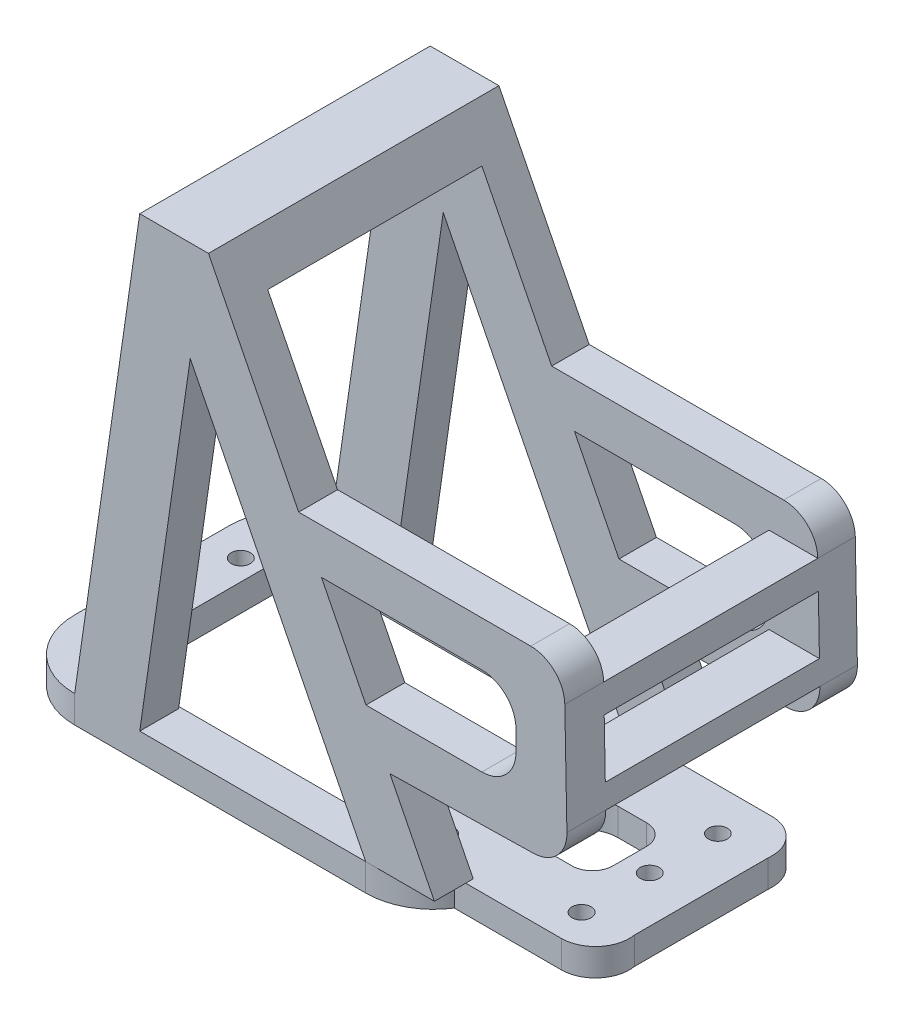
ISO-10303-21;
HEADER;
FILE_DESCRIPTION(('STEP AP214'),'2;1');
FILE_NAME('part.step','',(''),(''),'','','');
FILE_SCHEMA(('AUTOMOTIVE_DESIGN { 1 0 10303 214 1 1 1 1 }'));
ENDSEC;
DATA;
#1=APPLICATION_CONTEXT('core data for automotive mechanical design processes');
#2=APPLICATION_PROTOCOL_DEFINITION('international standard','automotive_design',2000,#1);
#3=PRODUCT_CONTEXT('',#1,'mechanical');
#4=PRODUCT('Part','Part','',(#3));
#5=PRODUCT_RELATED_PRODUCT_CATEGORY('part','',(#4));
#6=PRODUCT_DEFINITION_FORMATION('','',#4);
#7=PRODUCT_DEFINITION_CONTEXT('part definition',#1,'design');
#8=PRODUCT_DEFINITION('design','',#6,#7);
#9=PRODUCT_DEFINITION_SHAPE('','',#8);
#10=(LENGTH_UNIT() NAMED_UNIT(*) SI_UNIT(.MILLI.,.METRE.));
#11=(NAMED_UNIT(*) PLANE_ANGLE_UNIT() SI_UNIT($,.RADIAN.));
#12=(NAMED_UNIT(*) SI_UNIT($,.STERADIAN.) SOLID_ANGLE_UNIT());
#13=UNCERTAINTY_MEASURE_WITH_UNIT(LENGTH_MEASURE(1.E-05),#10,'distance_accuracy_value','');
#14=(GEOMETRIC_REPRESENTATION_CONTEXT(3) GLOBAL_UNCERTAINTY_ASSIGNED_CONTEXT((#13)) GLOBAL_UNIT_ASSIGNED_CONTEXT((#10,
#11,#12)) REPRESENTATION_CONTEXT('',''));
#15=CARTESIAN_POINT('',(0.,0.,0.));
#16=DIRECTION('',(0.,0.,1.));
#17=DIRECTION('',(1.,0.,0.));
#18=AXIS2_PLACEMENT_3D('',#15,#16,#17);
#19=CARTESIAN_POINT('',(0.,0.,15.0204741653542));
#20=DIRECTION('',(0.,0.,1.));
#21=DIRECTION('',(1.,0.,0.));
#22=AXIS2_PLACEMENT_3D('',#19,#20,#21);
#23=PLANE('',#22);
#24=DIRECTION('',(0.450231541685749,-0.892911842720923,0.));
#25=VECTOR('',#24,1.);
#26=CARTESIAN_POINT('',(35.4216439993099,17.8606001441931,15.0204741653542));
#27=LINE('',#26,#25);
#28=CARTESIAN_POINT('',(25.8341682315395,36.8747514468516,15.0204741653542));
#29=VERTEX_POINT('',#28);
#30=CARTESIAN_POINT('',(32.3709009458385,23.9109194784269,15.0204741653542));
#31=VERTEX_POINT('',#30);
#32=EDGE_CURVE('E627',#29,#31,#27,.T.);
#33=ORIENTED_EDGE('',*,*,#32,.T.);
#34=DIRECTION('',(-1.,0.,0.));
#35=VECTOR('',#34,1.);
#36=CARTESIAN_POINT('',(0.,23.9109194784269,15.0204741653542));
#37=LINE('',#36,#35);
#38=CARTESIAN_POINT('',(49.3813125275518,23.9109194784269,15.0204741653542));
#39=VERTEX_POINT('',#38);
#40=EDGE_CURVE('E643',#39,#31,#37,.T.);
#41=ORIENTED_EDGE('',*,*,#40,.F.);
#42=CARTESIAN_POINT('',(49.3813125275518,28.9109194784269,15.0204741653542));
#43=DIRECTION('',(0.,0.,1.));
#44=DIRECTION('',(1.,0.,0.));
#45=AXIS2_PLACEMENT_3D('',#42,#43,#44);
#46=CIRCLE('',#45,5.);
#47=CARTESIAN_POINT('',(54.3813125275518,28.9109194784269,15.0204741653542));
#48=VERTEX_POINT('',#47);
#49=EDGE_CURVE('E640',#48,#39,#46,.F.);
#50=ORIENTED_EDGE('',*,*,#49,.F.);
#51=DIRECTION('',(0.,-1.,0.));
#52=VECTOR('',#51,1.);
#53=CARTESIAN_POINT('',(54.3813125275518,0.,15.0204741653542));
#54=LINE('',#53,#52);
#55=CARTESIAN_POINT('',(54.3813125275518,31.8747514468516,15.0204741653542));
#56=VERTEX_POINT('',#55);
#57=EDGE_CURVE('E637',#56,#48,#54,.T.);
#58=ORIENTED_EDGE('',*,*,#57,.F.);
#59=CARTESIAN_POINT('',(49.3813125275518,31.8747514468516,15.0204741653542));
#60=DIRECTION('',(0.,0.,1.));
#61=DIRECTION('',(1.,0.,0.));
#62=AXIS2_PLACEMENT_3D('',#59,#60,#61);
#63=CIRCLE('',#62,5.);
#64=CARTESIAN_POINT('',(49.3813125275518,36.8747514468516,15.0204741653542));
#65=VERTEX_POINT('',#64);
#66=EDGE_CURVE('E635',#56,#65,#63,.T.);
#67=ORIENTED_EDGE('',*,*,#66,.T.);
#68=DIRECTION('',(1.,0.,0.));
#69=VECTOR('',#68,1.);
#70=CARTESIAN_POINT('',(0.,36.8747514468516,15.0204741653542));
#71=LINE('',#70,#69);
#72=EDGE_CURVE('E629',#29,#65,#71,.T.);
#73=ORIENTED_EDGE('',*,*,#72,.F.);
#74=EDGE_LOOP('',(#33,#41,#50,#58,#67,#73));
#75=FACE_BOUND('',#74,.T.);
#76=DIRECTION('',(1.,0.,0.));
#77=VECTOR('',#76,1.);
#78=CARTESIAN_POINT('',(0.,25.9610294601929,15.0204741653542));
#79=LINE('',#78,#77);
#80=CARTESIAN_POINT('',(54.3813125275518,25.9610294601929,15.0204741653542));
#81=VERTEX_POINT('',#80);
#82=CARTESIAN_POINT('',(61.7860647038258,25.9610294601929,15.0204741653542));
#83=VERTEX_POINT('',#82);
#84=EDGE_CURVE('E51',#81,#83,#79,.T.);
#85=ORIENTED_EDGE('',*,*,#84,.F.);
#86=DIRECTION('',(0.,1.,0.));
#87=VECTOR('',#86,1.);
#88=CARTESIAN_POINT('',(54.3813125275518,0.,15.0204741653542));
#89=LINE('',#88,#87);
#90=CARTESIAN_POINT('',(54.3813125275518,22.4558433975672,15.0204741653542));
#91=VERTEX_POINT('',#90);
#92=EDGE_CURVE('E1162',#91,#81,#89,.T.);
#93=ORIENTED_EDGE('',*,*,#92,.F.);
#94=DIRECTION('',(-1.,0.,0.));
#95=VECTOR('',#94,1.);
#96=CARTESIAN_POINT('',(0.,22.4558433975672,15.0204741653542));
#97=LINE('',#96,#95);
#98=CARTESIAN_POINT('',(61.8529191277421,22.4558433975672,15.0204741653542));
#99=VERTEX_POINT('',#98);
#100=EDGE_CURVE('E491',#99,#91,#97,.T.);
#101=ORIENTED_EDGE('',*,*,#100,.F.);
#102=CARTESIAN_POINT('',(56.8538283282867,22.3604957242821,15.0204741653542));
#103=DIRECTION('',(0.,0.,1.));
#104=DIRECTION('',(1.,0.,0.));
#105=AXIS2_PLACEMENT_3D('',#102,#103,#104);
#106=CIRCLE('',#105,5.);
#107=CARTESIAN_POINT('',(56.9491760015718,17.3614049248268,15.0204741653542));
#108=VERTEX_POINT('',#107);
#109=EDGE_CURVE('E659',#99,#108,#106,.F.);
#110=ORIENTED_EDGE('',*,*,#109,.T.);
#111=DIRECTION('',(-0.99981815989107,-0.0190695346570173,0.));
#112=VECTOR('',#111,1.);
#113=CARTESIAN_POINT('',(-0.310304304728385,16.2692946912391,15.0204741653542));
#114=LINE('',#113,#112);
#115=CARTESIAN_POINT('',(35.8760161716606,16.9594764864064,15.0204741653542));
#116=VERTEX_POINT('',#115);
#117=EDGE_CURVE('E657',#108,#116,#114,.T.);
#118=ORIENTED_EDGE('',*,*,#117,.T.);
#119=CARTESIAN_POINT('',(42.4105527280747,4.,15.0204741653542));
#120=VERTEX_POINT('',#119);
#121=EDGE_CURVE('E632',#116,#120,#27,.T.);
#122=ORIENTED_EDGE('',*,*,#121,.T.);
#123=DIRECTION('',(-1.,0.,0.));
#124=VECTOR('',#123,1.);
#125=CARTESIAN_POINT('',(0.,4.,15.0204741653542));
#126=LINE('',#125,#124);
#127=CARTESIAN_POINT('',(32.3278565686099,4.,15.0204741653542));
#128=VERTEX_POINT('',#127);
#129=EDGE_CURVE('E654',#120,#128,#126,.T.);
#130=ORIENTED_EDGE('',*,*,#129,.T.);
#131=DIRECTION('',(-0.450231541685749,0.892911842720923,0.));
#132=VECTOR('',#131,1.);
#133=CARTESIAN_POINT('',(27.3827954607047,13.8071841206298,15.0204741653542));
#134=LINE('',#133,#132);
#135=CARTESIAN_POINT('',(6.5867979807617,55.0503905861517,15.0204741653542));
#136=VERTEX_POINT('',#135);
#137=EDGE_CURVE('E652',#128,#136,#134,.T.);
#138=ORIENTED_EDGE('',*,*,#137,.T.);
#139=DIRECTION('',(0.14367784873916,0.989624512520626,0.));
#140=VECTOR('',#139,1.);
#141=CARTESIAN_POINT('',(-1.37663197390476,0.199865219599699,15.0204741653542));
#142=LINE('',#141,#140);
#143=CARTESIAN_POINT('',(-0.824912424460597,4.,15.0204741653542));
#144=VERTEX_POINT('',#143);
#145=EDGE_CURVE('E649',#144,#136,#142,.T.);
#146=ORIENTED_EDGE('',*,*,#145,.F.);
#147=DIRECTION('',(-1.,0.,0.));
#148=VECTOR('',#147,1.);
#149=CARTESIAN_POINT('',(0.,4.,15.0204741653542));
#150=LINE('',#149,#148);
#151=CARTESIAN_POINT('',(-10.3707017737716,4.,15.0204741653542));
#152=VERTEX_POINT('',#151);
#153=EDGE_CURVE('E646',#144,#152,#150,.T.);
#154=ORIENTED_EDGE('',*,*,#153,.T.);
#155=DIRECTION('',(0.14367784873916,0.989624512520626,0.));
#156=VECTOR('',#155,1.);
#157=CARTESIAN_POINT('',(-10.7253644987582,1.55715352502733,15.0204741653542));
#158=LINE('',#157,#156);
#159=CARTESIAN_POINT('',(-1.68844369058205,63.8016708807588,15.0204741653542));
#160=VERTEX_POINT('',#159);
#161=EDGE_CURVE('E666',#152,#160,#158,.T.);
#162=ORIENTED_EDGE('',*,*,#161,.T.);
#163=DIRECTION('',(-1.,0.,0.));
#164=VECTOR('',#163,1.);
#165=CARTESIAN_POINT('',(0.,63.8016708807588,15.0204741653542));
#166=LINE('',#165,#164);
#167=CARTESIAN_POINT('',(12.2568497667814,63.8016708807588,15.0204741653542));
#168=VERTEX_POINT('',#167);
#169=EDGE_CURVE('E541',#168,#160,#166,.T.);
#170=ORIENTED_EDGE('',*,*,#169,.F.);
#171=CARTESIAN_POINT('',(22.4989027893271,43.4893435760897,15.0204741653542));
#172=VERTEX_POINT('',#171);
#173=EDGE_CURVE('E631',#168,#172,#27,.T.);
#174=ORIENTED_EDGE('',*,*,#173,.T.);
#175=DIRECTION('',(1.,0.,0.));
#176=VECTOR('',#175,1.);
#177=CARTESIAN_POINT('',(0.,43.4893435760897,15.0204741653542));
#178=LINE('',#177,#176);
#179=CARTESIAN_POINT('',(56.5462027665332,43.4893435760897,15.0204741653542));
#180=VERTEX_POINT('',#179);
#181=EDGE_CURVE('E664',#172,#180,#178,.T.);
#182=ORIENTED_EDGE('',*,*,#181,.T.);
#183=CARTESIAN_POINT('',(56.5462027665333,38.4893435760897,15.0204741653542));
#184=DIRECTION('',(0.,0.,1.));
#185=DIRECTION('',(1.,0.,0.));
#186=AXIS2_PLACEMENT_3D('',#183,#184,#185);
#187=CIRCLE('',#186,5.);
#188=CARTESIAN_POINT('',(61.5452935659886,38.5846912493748,15.0204741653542));
#189=VERTEX_POINT('',#188);
#190=EDGE_CURVE('E662',#180,#189,#187,.F.);
#191=ORIENTED_EDGE('',*,*,#190,.T.);
#192=DIRECTION('',(1.,0.,0.));
#193=VECTOR('',#192,1.);
#194=CARTESIAN_POINT('',(0.,38.5846912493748,15.0204741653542));
#195=LINE('',#194,#193);
#196=CARTESIAN_POINT('',(54.3813125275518,38.5846912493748,15.0204741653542));
#197=VERTEX_POINT('',#196);
#198=EDGE_CURVE('E1082',#197,#189,#195,.T.);
#199=ORIENTED_EDGE('',*,*,#198,.F.);
#200=DIRECTION('',(0.,1.,0.));
#201=VECTOR('',#200,1.);
#202=CARTESIAN_POINT('',(54.3813125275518,0.,15.0204741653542));
#203=LINE('',#202,#201);
#204=CARTESIAN_POINT('',(54.3813125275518,34.4334737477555,15.0204741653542));
#205=VERTEX_POINT('',#204);
#206=EDGE_CURVE('E1098',#205,#197,#203,.T.);
#207=ORIENTED_EDGE('',*,*,#206,.F.);
#208=DIRECTION('',(-1.,0.,0.));
#209=VECTOR('',#208,1.);
#210=CARTESIAN_POINT('',(0.,34.4334737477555,15.0204741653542));
#211=LINE('',#210,#209);
#212=CARTESIAN_POINT('',(61.6244697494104,34.4334737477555,15.0204741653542));
#213=VERTEX_POINT('',#212);
#214=EDGE_CURVE('E1179',#213,#205,#211,.T.);
#215=ORIENTED_EDGE('',*,*,#214,.F.);
#216=DIRECTION('',(0.0190695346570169,-0.99981815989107,0.));
#217=VECTOR('',#216,1.);
#218=CARTESIAN_POINT('',(62.2585711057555,1.18745790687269,15.0204741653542));
#219=LINE('',#218,#217);
#220=EDGE_CURVE('E56',#213,#83,#219,.T.);
#221=ORIENTED_EDGE('',*,*,#220,.T.);
#222=EDGE_LOOP('',(#85,#93,#101,#110,#118,#122,#130,#138,#146,#154,#162,#170,#174,#182,#191,
#199,#207,#215,#221));
#223=FACE_BOUND('',#222,.T.);
#224=ADVANCED_FACE('F36',(#75,#223),#23,.F.);
#225=CARTESIAN_POINT('',(0.,0.,-16.3990480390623));
#226=DIRECTION('',(0.,0.,-1.));
#227=DIRECTION('',(-1.,0.,0.));
#228=AXIS2_PLACEMENT_3D('',#225,#226,#227);
#229=PLANE('',#228);
#230=DIRECTION('',(-0.450231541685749,0.892911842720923,0.));
#231=VECTOR('',#230,1.);
#232=CARTESIAN_POINT('',(35.4216439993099,17.8606001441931,-16.3990480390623));
#233=LINE('',#232,#231);
#234=CARTESIAN_POINT('',(32.3709009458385,23.9109194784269,-16.3990480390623));
#235=VERTEX_POINT('',#234);
#236=CARTESIAN_POINT('',(25.8341682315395,36.8747514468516,-16.3990480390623));
#237=VERTEX_POINT('',#236);
#238=EDGE_CURVE('E586',#235,#237,#233,.T.);
#239=ORIENTED_EDGE('',*,*,#238,.T.);
#240=DIRECTION('',(-1.,0.,0.));
#241=VECTOR('',#240,1.);
#242=CARTESIAN_POINT('',(0.,36.8747514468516,-16.3990480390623));
#243=LINE('',#242,#241);
#244=CARTESIAN_POINT('',(49.3813125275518,36.8747514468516,-16.3990480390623));
#245=VERTEX_POINT('',#244);
#246=EDGE_CURVE('E1116',#245,#237,#243,.T.);
#247=ORIENTED_EDGE('',*,*,#246,.F.);
#248=CARTESIAN_POINT('',(49.3813125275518,31.8747514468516,-16.3990480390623));
#249=DIRECTION('',(0.,0.,-1.));
#250=DIRECTION('',(-1.,0.,0.));
#251=AXIS2_PLACEMENT_3D('',#248,#249,#250);
#252=CIRCLE('',#251,5.);
#253=CARTESIAN_POINT('',(54.3813125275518,31.8747514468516,-16.3990480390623));
#254=VERTEX_POINT('',#253);
#255=EDGE_CURVE('E1114',#245,#254,#252,.T.);
#256=ORIENTED_EDGE('',*,*,#255,.T.);
#257=DIRECTION('',(0.,1.,0.));
#258=VECTOR('',#257,1.);
#259=CARTESIAN_POINT('',(54.3813125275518,0.,-16.3990480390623));
#260=LINE('',#259,#258);
#261=CARTESIAN_POINT('',(54.3813125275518,28.9109194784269,-16.3990480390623));
#262=VERTEX_POINT('',#261);
#263=EDGE_CURVE('E1111',#262,#254,#260,.T.);
#264=ORIENTED_EDGE('',*,*,#263,.F.);
#265=CARTESIAN_POINT('',(49.3813125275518,28.9109194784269,-16.3990480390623));
#266=DIRECTION('',(0.,0.,-1.));
#267=DIRECTION('',(-1.,0.,0.));
#268=AXIS2_PLACEMENT_3D('',#265,#266,#267);
#269=CIRCLE('',#268,5.);
#270=CARTESIAN_POINT('',(49.3813125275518,23.9109194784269,-16.3990480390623));
#271=VERTEX_POINT('',#270);
#272=EDGE_CURVE('E1108',#271,#262,#269,.F.);
#273=ORIENTED_EDGE('',*,*,#272,.F.);
#274=DIRECTION('',(1.,0.,0.));
#275=VECTOR('',#274,1.);
#276=CARTESIAN_POINT('',(0.,23.9109194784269,-16.3990480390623));
#277=LINE('',#276,#275);
#278=EDGE_CURVE('E1104',#235,#271,#277,.T.);
#279=ORIENTED_EDGE('',*,*,#278,.F.);
#280=EDGE_LOOP('',(#239,#247,#256,#264,#273,#279));
#281=FACE_BOUND('',#280,.T.);
#282=DIRECTION('',(-1.,0.,0.));
#283=VECTOR('',#282,1.);
#284=CARTESIAN_POINT('',(54.3813125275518,25.9610294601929,-16.3990480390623));
#285=LINE('',#284,#283);
#286=CARTESIAN_POINT('',(61.7860647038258,25.9610294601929,-16.3990480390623));
#287=VERTEX_POINT('',#286);
#288=CARTESIAN_POINT('',(54.3813125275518,25.9610294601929,-16.3990480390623));
#289=VERTEX_POINT('',#288);
#290=EDGE_CURVE('E487',#287,#289,#285,.T.);
#291=ORIENTED_EDGE('',*,*,#290,.F.);
#292=DIRECTION('',(0.0190695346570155,-0.99981815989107,0.));
#293=VECTOR('',#292,1.);
#294=CARTESIAN_POINT('',(62.2585711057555,1.1874579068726,-16.3990480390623));
#295=LINE('',#294,#293);
#296=CARTESIAN_POINT('',(61.6244697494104,34.4334737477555,-16.3990480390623));
#297=VERTEX_POINT('',#296);
#298=EDGE_CURVE('E498',#297,#287,#295,.T.);
#299=ORIENTED_EDGE('',*,*,#298,.F.);
#300=DIRECTION('',(1.,0.,0.));
#301=VECTOR('',#300,1.);
#302=CARTESIAN_POINT('',(54.3813125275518,34.4334737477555,-16.3990480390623));
#303=LINE('',#302,#301);
#304=CARTESIAN_POINT('',(54.3813125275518,34.4334737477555,-16.3990480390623));
#305=VERTEX_POINT('',#304);
#306=EDGE_CURVE('E1170',#305,#297,#303,.T.);
#307=ORIENTED_EDGE('',*,*,#306,.F.);
#308=DIRECTION('',(0.,-1.,0.));
#309=VECTOR('',#308,1.);
#310=CARTESIAN_POINT('',(54.3813125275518,38.5846912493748,-16.3990480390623));
#311=LINE('',#310,#309);
#312=CARTESIAN_POINT('',(54.3813125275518,38.5846912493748,-16.3990480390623));
#313=VERTEX_POINT('',#312);
#314=EDGE_CURVE('E1167',#313,#305,#311,.T.);
#315=ORIENTED_EDGE('',*,*,#314,.F.);
#316=DIRECTION('',(-1.,0.,0.));
#317=VECTOR('',#316,1.);
#318=CARTESIAN_POINT('',(61.5452935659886,38.5846912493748,-16.3990480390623));
#319=LINE('',#318,#317);
#320=CARTESIAN_POINT('',(61.5452935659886,38.5846912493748,-16.3990480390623));
#321=VERTEX_POINT('',#320);
#322=EDGE_CURVE('E1164',#321,#313,#319,.T.);
#323=ORIENTED_EDGE('',*,*,#322,.F.);
#324=CARTESIAN_POINT('',(56.5462027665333,38.4893435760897,-16.3990480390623));
#325=DIRECTION('',(0.,0.,-1.));
#326=DIRECTION('',(-1.,0.,0.));
#327=AXIS2_PLACEMENT_3D('',#324,#325,#326);
#328=CIRCLE('',#327,5.00000000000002);
#329=CARTESIAN_POINT('',(56.5462027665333,43.4893435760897,-16.3990480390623));
#330=VERTEX_POINT('',#329);
#331=EDGE_CURVE('E508',#330,#321,#328,.T.);
#332=ORIENTED_EDGE('',*,*,#331,.F.);
#333=DIRECTION('',(1.,0.,0.));
#334=VECTOR('',#333,1.);
#335=CARTESIAN_POINT('',(0.,43.4893435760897,-16.3990480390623));
#336=LINE('',#335,#334);
#337=CARTESIAN_POINT('',(22.4989027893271,43.4893435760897,-16.3990480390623));
#338=VERTEX_POINT('',#337);
#339=EDGE_CURVE('E514',#338,#330,#336,.T.);
#340=ORIENTED_EDGE('',*,*,#339,.F.);
#341=CARTESIAN_POINT('',(12.2568497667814,63.8016708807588,-16.3990480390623));
#342=VERTEX_POINT('',#341);
#343=EDGE_CURVE('E1105',#338,#342,#233,.T.);
#344=ORIENTED_EDGE('',*,*,#343,.T.);
#345=DIRECTION('',(1.,0.,0.));
#346=VECTOR('',#345,1.);
#347=CARTESIAN_POINT('',(12.2568497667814,63.8016708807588,-16.3990480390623));
#348=LINE('',#347,#346);
#349=CARTESIAN_POINT('',(-1.68844369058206,63.8016708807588,-16.3990480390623));
#350=VERTEX_POINT('',#349);
#351=EDGE_CURVE('E1094',#350,#342,#348,.T.);
#352=ORIENTED_EDGE('',*,*,#351,.F.);
#353=DIRECTION('',(0.14367784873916,0.989624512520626,0.));
#354=VECTOR('',#353,1.);
#355=CARTESIAN_POINT('',(-10.7253644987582,1.55715352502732,-16.3990480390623));
#356=LINE('',#355,#354);
#357=CARTESIAN_POINT('',(-10.3707017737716,4.,-16.3990480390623));
#358=VERTEX_POINT('',#357);
#359=EDGE_CURVE('E533',#358,#350,#356,.T.);
#360=ORIENTED_EDGE('',*,*,#359,.F.);
#361=DIRECTION('',(1.,0.,0.));
#362=VECTOR('',#361,1.);
#363=CARTESIAN_POINT('',(0.,4.,-16.3990480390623));
#364=LINE('',#363,#362);
#365=CARTESIAN_POINT('',(-0.824912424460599,4.,-16.3990480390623));
#366=VERTEX_POINT('',#365);
#367=EDGE_CURVE('E530',#358,#366,#364,.T.);
#368=ORIENTED_EDGE('',*,*,#367,.T.);
#369=DIRECTION('',(0.14367784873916,0.989624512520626,0.));
#370=VECTOR('',#369,1.);
#371=CARTESIAN_POINT('',(-1.37663197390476,0.199865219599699,-16.3990480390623));
#372=LINE('',#371,#370);
#373=CARTESIAN_POINT('',(6.5867979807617,55.0503905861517,-16.3990480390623));
#374=VERTEX_POINT('',#373);
#375=EDGE_CURVE('E528',#366,#374,#372,.T.);
#376=ORIENTED_EDGE('',*,*,#375,.T.);
#377=DIRECTION('',(0.450231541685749,-0.892911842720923,0.));
#378=VECTOR('',#377,1.);
#379=CARTESIAN_POINT('',(27.3827954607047,13.8071841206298,-16.3990480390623));
#380=LINE('',#379,#378);
#381=CARTESIAN_POINT('',(32.3278565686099,4.,-16.3990480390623));
#382=VERTEX_POINT('',#381);
#383=EDGE_CURVE('E524',#374,#382,#380,.T.);
#384=ORIENTED_EDGE('',*,*,#383,.T.);
#385=DIRECTION('',(1.,0.,0.));
#386=VECTOR('',#385,1.);
#387=CARTESIAN_POINT('',(0.,4.,-16.3990480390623));
#388=LINE('',#387,#386);
#389=CARTESIAN_POINT('',(40.5986348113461,4.,-16.3990480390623));
#390=VERTEX_POINT('',#389);
#391=EDGE_CURVE('E521',#382,#390,#388,.T.);
#392=ORIENTED_EDGE('',*,*,#391,.T.);
#393=CARTESIAN_POINT('',(42.4105527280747,4.,-16.3990480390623));
#394=VERTEX_POINT('',#393);
#395=EDGE_CURVE('E525',#390,#394,#388,.T.);
#396=ORIENTED_EDGE('',*,*,#395,.T.);
#397=CARTESIAN_POINT('',(35.8760161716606,16.9594764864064,-16.3990480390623));
#398=VERTEX_POINT('',#397);
#399=EDGE_CURVE('E520',#394,#398,#233,.T.);
#400=ORIENTED_EDGE('',*,*,#399,.T.);
#401=DIRECTION('',(-0.99981815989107,-0.0190695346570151,0.));
#402=VECTOR('',#401,1.);
#403=CARTESIAN_POINT('',(-0.310304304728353,16.2692946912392,-16.3990480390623));
#404=LINE('',#403,#402);
#405=CARTESIAN_POINT('',(56.9491760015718,17.3614049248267,-16.3990480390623));
#406=VERTEX_POINT('',#405);
#407=EDGE_CURVE('E511',#406,#398,#404,.T.);
#408=ORIENTED_EDGE('',*,*,#407,.F.);
#409=CARTESIAN_POINT('',(56.8538283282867,22.3604957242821,-16.3990480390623));
#410=DIRECTION('',(0.,0.,-1.));
#411=DIRECTION('',(-1.,0.,0.));
#412=AXIS2_PLACEMENT_3D('',#409,#410,#411);
#413=CIRCLE('',#412,5.00000000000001);
#414=CARTESIAN_POINT('',(61.8529191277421,22.4558433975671,-16.3990480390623));
#415=VERTEX_POINT('',#414);
#416=EDGE_CURVE('E507',#406,#415,#413,.F.);
#417=ORIENTED_EDGE('',*,*,#416,.T.);
#418=DIRECTION('',(1.,0.,0.));
#419=VECTOR('',#418,1.);
#420=CARTESIAN_POINT('',(61.8529191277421,22.4558433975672,-16.3990480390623));
#421=LINE('',#420,#419);
#422=CARTESIAN_POINT('',(54.3813125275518,22.4558433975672,-16.3990480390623));
#423=VERTEX_POINT('',#422);
#424=EDGE_CURVE('E1139',#423,#415,#421,.T.);
#425=ORIENTED_EDGE('',*,*,#424,.F.);
#426=DIRECTION('',(0.,-1.,0.));
#427=VECTOR('',#426,1.);
#428=CARTESIAN_POINT('',(54.3813125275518,22.4558433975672,-16.3990480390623));
#429=LINE('',#428,#427);
#430=EDGE_CURVE('E501',#289,#423,#429,.T.);
#431=ORIENTED_EDGE('',*,*,#430,.F.);
#432=EDGE_LOOP('',(#291,#299,#307,#315,#323,#332,#340,#344,#352,#360,#368,#376,#384,#392,#396,
#400,#408,#417,#425,#431));
#433=FACE_BOUND('',#432,.T.);
#434=ADVANCED_FACE('F496',(#281,#433),#229,.F.);
#435=CARTESIAN_POINT('',(-10.3707017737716,4.,10.7204741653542));
#436=DIRECTION('',(0.,1.,0.));
#437=DIRECTION('',(0.,0.,1.));
#438=AXIS2_PLACEMENT_3D('',#435,#436,#437);
#439=PLANE('',#438);
#440=CARTESIAN_POINT('',(54.6080206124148,4.,1.32752990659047));
#441=DIRECTION('',(0.,1.,0.));
#442=DIRECTION('',(0.,0.,1.));
#443=AXIS2_PLACEMENT_3D('',#440,#441,#442);
#444=CIRCLE('',#443,1.39699570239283);
#445=CARTESIAN_POINT('',(54.6080206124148,4.,2.7245256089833));
#446=VERTEX_POINT('',#445);
#447=EDGE_CURVE('E767',#446,#446,#444,.T.);
#448=ORIENTED_EDGE('',*,*,#447,.F.);
#449=EDGE_LOOP('',(#448));
#450=FACE_BOUND('',#449,.T.);
#451=CARTESIAN_POINT('',(34.6080206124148,4.,11.3275299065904));
#452=DIRECTION('',(0.,1.,0.));
#453=DIRECTION('',(0.,0.,1.));
#454=AXIS2_PLACEMENT_3D('',#451,#452,#453);
#455=CIRCLE('',#454,1.39114909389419);
#456=CARTESIAN_POINT('',(34.6080206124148,4.,12.7186790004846));
#457=VERTEX_POINT('',#456);
#458=EDGE_CURVE('E779',#457,#457,#455,.T.);
#459=ORIENTED_EDGE('',*,*,#458,.F.);
#460=EDGE_LOOP('',(#459));
#461=FACE_BOUND('',#460,.T.);
#462=CARTESIAN_POINT('',(-15.3919793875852,4.,11.3275299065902));
#463=DIRECTION('',(0.,1.,0.));
#464=DIRECTION('',(0.,0.,1.));
#465=AXIS2_PLACEMENT_3D('',#462,#463,#464);
#466=CIRCLE('',#465,1.38272659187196);
#467=CARTESIAN_POINT('',(-15.3919793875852,4.,12.7102564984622));
#468=VERTEX_POINT('',#467);
#469=EDGE_CURVE('E791',#468,#468,#466,.T.);
#470=ORIENTED_EDGE('',*,*,#469,.F.);
#471=EDGE_LOOP('',(#470));
#472=FACE_BOUND('',#471,.T.);
#473=CARTESIAN_POINT('',(-15.3919793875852,4.,-8.67247009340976));
#474=DIRECTION('',(0.,1.,0.));
#475=DIRECTION('',(0.,0.,1.));
#476=AXIS2_PLACEMENT_3D('',#473,#474,#475);
#477=CIRCLE('',#476,1.4);
#478=CARTESIAN_POINT('',(-15.3919793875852,4.,-7.27247009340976));
#479=VERTEX_POINT('',#478);
#480=EDGE_CURVE('E803',#479,#479,#477,.T.);
#481=ORIENTED_EDGE('',*,*,#480,.F.);
#482=EDGE_LOOP('',(#481));
#483=FACE_BOUND('',#482,.T.);
#484=DIRECTION('',(1.,0.,0.));
#485=VECTOR('',#484,1.);
#486=CARTESIAN_POINT('',(43.8279515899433,4.,6.12757627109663));
#487=LINE('',#486,#485);
#488=CARTESIAN_POINT('',(43.8279515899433,4.,6.12757627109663));
#489=VERTEX_POINT('',#488);
#490=CARTESIAN_POINT('',(48.0080206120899,4.,6.12757627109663));
#491=VERTEX_POINT('',#490);
#492=EDGE_CURVE('E870',#489,#491,#487,.T.);
#493=ORIENTED_EDGE('',*,*,#492,.F.);
#494=CARTESIAN_POINT('',(43.8279515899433,4.,1.12757627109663));
#495=DIRECTION('',(0.,1.,0.));
#496=DIRECTION('',(0.,0.,1.));
#497=AXIS2_PLACEMENT_3D('',#494,#495,#496);
#498=CIRCLE('',#497,5.00000000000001);
#499=CARTESIAN_POINT('',(38.8300804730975,4.,1.27346766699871));
#500=VERTEX_POINT('',#499);
#501=EDGE_CURVE('E868',#500,#489,#498,.T.);
#502=ORIENTED_EDGE('',*,*,#501,.F.);
#503=DIRECTION('',(0.0291782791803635,0.,0.999574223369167));
#504=VECTOR('',#503,1.);
#505=CARTESIAN_POINT('',(38.8022372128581,4.,0.319627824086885));
#506=LINE('',#505,#504);
#507=CARTESIAN_POINT('',(38.8022372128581,4.,0.319627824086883));
#508=VERTEX_POINT('',#507);
#509=EDGE_CURVE('E884',#508,#500,#506,.T.);
#510=ORIENTED_EDGE('',*,*,#509,.F.);
#511=CARTESIAN_POINT('',(43.8001083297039,4.,0.173736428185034));
#512=DIRECTION('',(0.,1.,0.));
#513=DIRECTION('',(0.,0.,-1.));
#514=AXIS2_PLACEMENT_3D('',#511,#512,#513);
#515=CIRCLE('',#514,5.);
#516=CARTESIAN_POINT('',(43.8001083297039,4.,-4.82626357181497));
#517=VERTEX_POINT('',#516);
#518=EDGE_CURVE('E881',#517,#508,#515,.T.);
#519=ORIENTED_EDGE('',*,*,#518,.F.);
#520=DIRECTION('',(-1.,0.,0.));
#521=VECTOR('',#520,1.);
#522=CARTESIAN_POINT('',(43.800108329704,4.,-4.82626357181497));
#523=LINE('',#522,#521);
#524=CARTESIAN_POINT('',(48.0080206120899,4.,-4.82626357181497));
#525=VERTEX_POINT('',#524);
#526=EDGE_CURVE('E879',#525,#517,#523,.T.);
#527=ORIENTED_EDGE('',*,*,#526,.F.);
#528=CARTESIAN_POINT('',(48.0080206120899,4.,-1.82626357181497));
#529=DIRECTION('',(0.,1.,0.));
#530=DIRECTION('',(0.,0.,1.));
#531=AXIS2_PLACEMENT_3D('',#528,#529,#530);
#532=CIRCLE('',#531,3.);
#533=CARTESIAN_POINT('',(51.0080206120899,4.,-1.82626357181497));
#534=VERTEX_POINT('',#533);
#535=EDGE_CURVE('E877',#534,#525,#532,.T.);
#536=ORIENTED_EDGE('',*,*,#535,.F.);
#537=DIRECTION('',(0.,0.,-1.));
#538=VECTOR('',#537,1.);
#539=CARTESIAN_POINT('',(51.0080206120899,4.,-1.82626357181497));
#540=LINE('',#539,#538);
#541=CARTESIAN_POINT('',(51.0080206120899,4.,3.12757627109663));
#542=VERTEX_POINT('',#541);
#543=EDGE_CURVE('E875',#542,#534,#540,.T.);
#544=ORIENTED_EDGE('',*,*,#543,.F.);
#545=CARTESIAN_POINT('',(48.0080206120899,4.,3.12757627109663));
#546=DIRECTION('',(0.,1.,0.));
#547=DIRECTION('',(0.,0.,-1.));
#548=AXIS2_PLACEMENT_3D('',#545,#546,#547);
#549=CIRCLE('',#548,3.);
#550=EDGE_CURVE('E873',#491,#542,#549,.T.);
#551=ORIENTED_EDGE('',*,*,#550,.F.);
#552=EDGE_LOOP('',(#493,#502,#510,#519,#527,#536,#544,#551));
#553=FACE_BOUND('',#552,.T.);
#554=DIRECTION('',(1.,0.,0.));
#555=VECTOR('',#554,1.);
#556=CARTESIAN_POINT('',(-7.37070177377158,4.,14.7204741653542));
#557=LINE('',#556,#555);
#558=CARTESIAN_POINT('',(-7.37070177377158,4.,14.7204741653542));
#559=VERTEX_POINT('',#558);
#560=CARTESIAN_POINT('',(23.8661720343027,4.,14.7204741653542));
#561=VERTEX_POINT('',#560);
#562=EDGE_CURVE('E811',#559,#561,#557,.T.);
#563=ORIENTED_EDGE('',*,*,#562,.F.);
#564=CARTESIAN_POINT('',(-7.37070177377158,4.,9.72047416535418));
#565=DIRECTION('',(0.,1.,0.));
#566=DIRECTION('',(0.,0.,-1.));
#567=AXIS2_PLACEMENT_3D('',#564,#565,#566);
#568=CIRCLE('',#567,5.);
#569=CARTESIAN_POINT('',(-12.3707017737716,4.,9.72047416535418));
#570=VERTEX_POINT('',#569);
#571=EDGE_CURVE('E809',#570,#559,#568,.T.);
#572=ORIENTED_EDGE('',*,*,#571,.F.);
#573=DIRECTION('',(0.,0.,1.));
#574=VECTOR('',#573,1.);
#575=CARTESIAN_POINT('',(-12.3707017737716,4.,-10.8990480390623));
#576=LINE('',#575,#574);
#577=CARTESIAN_POINT('',(-12.3707017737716,4.,-10.8990480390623));
#578=VERTEX_POINT('',#577);
#579=EDGE_CURVE('E825',#578,#570,#576,.T.);
#580=ORIENTED_EDGE('',*,*,#579,.F.);
#581=CARTESIAN_POINT('',(-7.37070177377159,4.,-10.8990480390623));
#582=DIRECTION('',(0.,1.,0.));
#583=DIRECTION('',(0.,0.,1.));
#584=AXIS2_PLACEMENT_3D('',#581,#582,#583);
#585=CIRCLE('',#584,5.);
#586=CARTESIAN_POINT('',(-7.37070177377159,4.,-15.8990480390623));
#587=VERTEX_POINT('',#586);
#588=EDGE_CURVE('E822',#587,#578,#585,.T.);
#589=ORIENTED_EDGE('',*,*,#588,.F.);
#590=DIRECTION('',(-1.,0.,0.));
#591=VECTOR('',#590,1.);
#592=CARTESIAN_POINT('',(-7.37070177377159,4.,-15.8990480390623));
#593=LINE('',#592,#591);
#594=CARTESIAN_POINT('',(23.8661720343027,4.,-15.8990480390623));
#595=VERTEX_POINT('',#594);
#596=EDGE_CURVE('E820',#595,#587,#593,.T.);
#597=ORIENTED_EDGE('',*,*,#596,.F.);
#598=CARTESIAN_POINT('',(23.8661720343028,4.,-10.8990480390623));
#599=DIRECTION('',(0.,1.,0.));
#600=DIRECTION('',(0.,0.,1.));
#601=AXIS2_PLACEMENT_3D('',#598,#599,#600);
#602=CIRCLE('',#601,5.);
#603=CARTESIAN_POINT('',(28.8661720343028,4.,-10.8990480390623));
#604=VERTEX_POINT('',#603);
#605=EDGE_CURVE('E818',#604,#595,#602,.T.);
#606=ORIENTED_EDGE('',*,*,#605,.F.);
#607=DIRECTION('',(0.,0.,-1.));
#608=VECTOR('',#607,1.);
#609=CARTESIAN_POINT('',(28.8661720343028,4.,9.72047416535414));
#610=LINE('',#609,#608);
#611=CARTESIAN_POINT('',(28.8661720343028,4.,9.72047416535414));
#612=VERTEX_POINT('',#611);
#613=EDGE_CURVE('E816',#612,#604,#610,.T.);
#614=ORIENTED_EDGE('',*,*,#613,.F.);
#615=CARTESIAN_POINT('',(23.8661720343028,4.,9.72047416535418));
#616=DIRECTION('',(0.,1.,0.));
#617=DIRECTION('',(0.,0.,-1.));
#618=AXIS2_PLACEMENT_3D('',#615,#616,#617);
#619=CIRCLE('',#618,5.);
#620=EDGE_CURVE('E814',#561,#612,#619,.T.);
#621=ORIENTED_EDGE('',*,*,#620,.F.);
#622=EDGE_LOOP('',(#563,#572,#580,#589,#597,#606,#614,#621));
#623=FACE_BOUND('',#622,.T.);
#624=CARTESIAN_POINT('',(-15.3919793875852,4.,1.32752990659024));
#625=DIRECTION('',(0.,1.,0.));
#626=DIRECTION('',(0.,0.,1.));
#627=AXIS2_PLACEMENT_3D('',#624,#625,#626);
#628=CIRCLE('',#627,1.3979150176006);
#629=CARTESIAN_POINT('',(-15.3919793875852,4.,2.72544492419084));
#630=VERTEX_POINT('',#629);
#631=EDGE_CURVE('E797',#630,#630,#628,.T.);
#632=ORIENTED_EDGE('',*,*,#631,.F.);
#633=EDGE_LOOP('',(#632));
#634=FACE_BOUND('',#633,.T.);
#635=CARTESIAN_POINT('',(34.6080206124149,4.,-8.6724700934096));
#636=DIRECTION('',(0.,1.,0.));
#637=DIRECTION('',(0.,0.,1.));
#638=AXIS2_PLACEMENT_3D('',#635,#636,#637);
#639=CIRCLE('',#638,1.38856257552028);
#640=CARTESIAN_POINT('',(34.6080206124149,4.,-7.28390751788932));
#641=VERTEX_POINT('',#640);
#642=EDGE_CURVE('E785',#641,#641,#639,.T.);
#643=ORIENTED_EDGE('',*,*,#642,.F.);
#644=EDGE_LOOP('',(#643));
#645=FACE_BOUND('',#644,.T.);
#646=CARTESIAN_POINT('',(54.6080206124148,4.,-8.67247009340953));
#647=DIRECTION('',(0.,1.,0.));
#648=DIRECTION('',(0.,0.,1.));
#649=AXIS2_PLACEMENT_3D('',#646,#647,#648);
#650=CIRCLE('',#649,1.3880201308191);
#651=CARTESIAN_POINT('',(54.6080206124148,4.,-7.28444996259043));
#652=VERTEX_POINT('',#651);
#653=EDGE_CURVE('E773',#652,#652,#650,.T.);
#654=ORIENTED_EDGE('',*,*,#653,.F.);
#655=EDGE_LOOP('',(#654));
#656=FACE_BOUND('',#655,.T.);
#657=CARTESIAN_POINT('',(54.6080206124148,4.,11.3275299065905));
#658=DIRECTION('',(0.,1.,0.));
#659=DIRECTION('',(0.,0.,1.));
#660=AXIS2_PLACEMENT_3D('',#657,#658,#659);
#661=CIRCLE('',#660,1.40353949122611);
#662=CARTESIAN_POINT('',(54.6080206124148,4.,12.7310693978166));
#663=VERTEX_POINT('',#662);
#664=EDGE_CURVE('E761',#663,#663,#661,.T.);
#665=ORIENTED_EDGE('',*,*,#664,.F.);
#666=EDGE_LOOP('',(#665));
#667=FACE_BOUND('',#666,.T.);
#668=ORIENTED_EDGE('',*,*,#391,.F.);
#669=DIRECTION('',(0.,0.,-1.));
#670=VECTOR('',#669,1.);
#671=CARTESIAN_POINT('',(32.3278565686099,4.,-16.3990480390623));
#672=LINE('',#671,#670);
#673=CARTESIAN_POINT('',(32.3278565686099,4.,-21.8772768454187));
#674=VERTEX_POINT('',#673);
#675=EDGE_CURVE('E597',#382,#674,#672,.T.);
#676=ORIENTED_EDGE('',*,*,#675,.T.);
#677=CARTESIAN_POINT('',(31.6683492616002,4.,-11.8990480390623));
#678=DIRECTION('',(0.,1.,0.));
#679=DIRECTION('',(0.,0.,-1.));
#680=AXIS2_PLACEMENT_3D('',#677,#678,#679);
#681=CIRCLE('',#680,10.);
#682=CARTESIAN_POINT('',(31.6683492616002,4.,-21.8990480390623));
#683=VERTEX_POINT('',#682);
#684=EDGE_CURVE('E947',#674,#683,#681,.T.);
#685=ORIENTED_EDGE('',*,*,#684,.T.);
#686=DIRECTION('',(-1.,0.,0.));
#687=VECTOR('',#686,1.);
#688=CARTESIAN_POINT('',(-10.3707017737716,4.,-21.8990480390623));
#689=LINE('',#688,#687);
#690=CARTESIAN_POINT('',(-0.824912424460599,4.,-21.8990480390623));
#691=VERTEX_POINT('',#690);
#692=EDGE_CURVE('E951',#683,#691,#689,.T.);
#693=ORIENTED_EDGE('',*,*,#692,.T.);
#694=DIRECTION('',(0.,0.,-1.));
#695=VECTOR('',#694,1.);
#696=CARTESIAN_POINT('',(-0.8249124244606,4.,-16.3990480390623));
#697=LINE('',#696,#695);
#698=EDGE_CURVE('E591',#366,#691,#697,.T.);
#699=ORIENTED_EDGE('',*,*,#698,.F.);
#700=ORIENTED_EDGE('',*,*,#367,.F.);
#701=DIRECTION('',(0.,0.,-1.));
#702=VECTOR('',#701,1.);
#703=CARTESIAN_POINT('',(-10.3707017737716,4.,-16.3990480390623));
#704=LINE('',#703,#702);
#705=CARTESIAN_POINT('',(-10.3707017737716,4.,-21.8990480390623));
#706=VERTEX_POINT('',#705);
#707=EDGE_CURVE('E587',#358,#706,#704,.T.);
#708=ORIENTED_EDGE('',*,*,#707,.T.);
#709=CARTESIAN_POINT('',(-10.3707017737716,4.,-11.8990480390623));
#710=DIRECTION('',(0.,1.,0.));
#711=DIRECTION('',(0.,0.,1.));
#712=AXIS2_PLACEMENT_3D('',#709,#710,#711);
#713=CIRCLE('',#712,10.);
#714=CARTESIAN_POINT('',(-20.3707017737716,4.,-11.8990480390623));
#715=VERTEX_POINT('',#714);
#716=EDGE_CURVE('E954',#706,#715,#713,.T.);
#717=ORIENTED_EDGE('',*,*,#716,.T.);
#718=DIRECTION('',(0.,0.,1.));
#719=VECTOR('',#718,1.);
#720=CARTESIAN_POINT('',(-20.3707017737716,4.,-11.8990480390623));
#721=LINE('',#720,#719);
#722=CARTESIAN_POINT('',(-20.3707017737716,4.,10.7204741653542));
#723=VERTEX_POINT('',#722);
#724=EDGE_CURVE('E956',#715,#723,#721,.T.);
#725=ORIENTED_EDGE('',*,*,#724,.T.);
#726=CARTESIAN_POINT('',(-10.3707017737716,4.,10.7204741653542));
#727=DIRECTION('',(0.,1.,0.));
#728=DIRECTION('',(0.,0.,1.));
#729=AXIS2_PLACEMENT_3D('',#726,#727,#728);
#730=CIRCLE('',#729,10.);
#731=CARTESIAN_POINT('',(-10.3707017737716,4.,20.7204741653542));
#732=VERTEX_POINT('',#731);
#733=EDGE_CURVE('E927',#723,#732,#730,.T.);
#734=ORIENTED_EDGE('',*,*,#733,.T.);
#735=DIRECTION('',(0.,0.,1.));
#736=VECTOR('',#735,1.);
#737=CARTESIAN_POINT('',(-10.3707017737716,4.,15.0204741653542));
#738=LINE('',#737,#736);
#739=EDGE_CURVE('E714',#152,#732,#738,.T.);
#740=ORIENTED_EDGE('',*,*,#739,.F.);
#741=ORIENTED_EDGE('',*,*,#153,.F.);
#742=DIRECTION('',(0.,0.,1.));
#743=VECTOR('',#742,1.);
#744=CARTESIAN_POINT('',(-0.824912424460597,4.,15.0204741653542));
#745=LINE('',#744,#743);
#746=CARTESIAN_POINT('',(-0.824912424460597,4.,20.7204741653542));
#747=VERTEX_POINT('',#746);
#748=EDGE_CURVE('E747',#144,#747,#745,.T.);
#749=ORIENTED_EDGE('',*,*,#748,.T.);
#750=DIRECTION('',(1.,0.,0.));
#751=VECTOR('',#750,1.);
#752=CARTESIAN_POINT('',(-10.3707017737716,4.,20.7204741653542));
#753=LINE('',#752,#751);
#754=CARTESIAN_POINT('',(32.3278565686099,4.,20.7204741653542));
#755=VERTEX_POINT('',#754);
#756=EDGE_CURVE('E929',#747,#755,#753,.T.);
#757=ORIENTED_EDGE('',*,*,#756,.T.);
#758=DIRECTION('',(0.,0.,1.));
#759=VECTOR('',#758,1.);
#760=CARTESIAN_POINT('',(32.3278565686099,4.,15.0204741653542));
#761=LINE('',#760,#759);
#762=EDGE_CURVE('E742',#128,#755,#761,.T.);
#763=ORIENTED_EDGE('',*,*,#762,.F.);
#764=ORIENTED_EDGE('',*,*,#129,.F.);
#765=DIRECTION('',(0.,0.,1.));
#766=VECTOR('',#765,1.);
#767=CARTESIAN_POINT('',(42.4105527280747,4.,15.0204741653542));
#768=LINE('',#767,#766);
#769=CARTESIAN_POINT('',(42.4105527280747,4.,16.1275762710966));
#770=VERTEX_POINT('',#769);
#771=EDGE_CURVE('E738',#120,#770,#768,.T.);
#772=ORIENTED_EDGE('',*,*,#771,.T.);
#773=DIRECTION('',(1.,0.,0.));
#774=VECTOR('',#773,1.);
#775=CARTESIAN_POINT('',(40.7399458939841,4.,16.1275762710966));
#776=LINE('',#775,#774);
#777=CARTESIAN_POINT('',(56.439926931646,4.,16.1275762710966));
#778=VERTEX_POINT('',#777);
#779=EDGE_CURVE('E935',#770,#778,#776,.T.);
#780=ORIENTED_EDGE('',*,*,#779,.T.);
#781=CARTESIAN_POINT('',(56.439926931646,4.,11.1275762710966));
#782=DIRECTION('',(0.,1.,0.));
#783=DIRECTION('',(0.,0.,-1.));
#784=AXIS2_PLACEMENT_3D('',#781,#782,#783);
#785=CIRCLE('',#784,5.);
#786=CARTESIAN_POINT('',(61.3782466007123,4.,10.344633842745));
#787=VERTEX_POINT('',#786);
#788=EDGE_CURVE('E939',#778,#787,#785,.T.);
#789=ORIENTED_EDGE('',*,*,#788,.T.);
#790=DIRECTION('',(0.,0.,-1.));
#791=VECTOR('',#790,1.);
#792=CARTESIAN_POINT('',(61.3782466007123,4.,-9.27088162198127));
#793=LINE('',#792,#791);
#794=CARTESIAN_POINT('',(61.3782466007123,4.,-9.27088162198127));
#795=VERTEX_POINT('',#794);
#796=EDGE_CURVE('E941',#787,#795,#793,.T.);
#797=ORIENTED_EDGE('',*,*,#796,.T.);
#798=CARTESIAN_POINT('',(56.4091872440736,4.,-9.82626357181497));
#799=DIRECTION('',(0.,1.,0.));
#800=DIRECTION('',(0.,0.,1.));
#801=AXIS2_PLACEMENT_3D('',#798,#799,#800);
#802=CIRCLE('',#801,5.);
#803=CARTESIAN_POINT('',(56.4091872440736,4.,-14.826263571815));
#804=VERTEX_POINT('',#803);
#805=EDGE_CURVE('E943',#795,#804,#802,.T.);
#806=ORIENTED_EDGE('',*,*,#805,.T.);
#807=DIRECTION('',(-1.,0.,0.));
#808=VECTOR('',#807,1.);
#809=CARTESIAN_POINT('',(41.2303265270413,4.,-14.826263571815));
#810=LINE('',#809,#808);
#811=CARTESIAN_POINT('',(41.2303265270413,4.,-14.826263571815));
#812=VERTEX_POINT('',#811);
#813=EDGE_CURVE('E945',#804,#812,#810,.T.);
#814=ORIENTED_EDGE('',*,*,#813,.T.);
#815=EDGE_CURVE('E948',#812,#390,#681,.T.);
#816=ORIENTED_EDGE('',*,*,#815,.T.);
#817=EDGE_LOOP('',(#668,#676,#685,#693,#699,#700,#708,#717,#725,#734,#740,#741,#749,#757,#763,
#764,#772,#780,#789,#797,#806,#814,#816));
#818=FACE_BOUND('',#817,.T.);
#819=ADVANCED_FACE('F1034',(#450,#461,#472,#483,#553,#623,#634,#645,#656,#667,#818),#439,.T.);
#820=CARTESIAN_POINT('',(-10.3707017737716,0.,10.7204741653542));
#821=DIRECTION('',(0.,1.,0.));
#822=DIRECTION('',(0.,0.,1.));
#823=AXIS2_PLACEMENT_3D('',#820,#821,#822);
#824=PLANE('',#823);
#825=CARTESIAN_POINT('',(43.8279515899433,0.,1.12757627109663));
#826=DIRECTION('',(0.,1.,0.));
#827=DIRECTION('',(0.,0.,1.));
#828=AXIS2_PLACEMENT_3D('',#825,#826,#827);
#829=CIRCLE('',#828,5.00000000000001);
#830=CARTESIAN_POINT('',(38.8300804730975,0.,1.27346766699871));
#831=VERTEX_POINT('',#830);
#832=CARTESIAN_POINT('',(43.8279515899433,0.,6.12757627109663));
#833=VERTEX_POINT('',#832);
#834=EDGE_CURVE('E867',#831,#833,#829,.T.);
#835=ORIENTED_EDGE('',*,*,#834,.T.);
#836=DIRECTION('',(1.,0.,0.));
#837=VECTOR('',#836,1.);
#838=CARTESIAN_POINT('',(43.8279515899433,0.,6.12757627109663));
#839=LINE('',#838,#837);
#840=CARTESIAN_POINT('',(48.0080206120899,0.,6.12757627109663));
#841=VERTEX_POINT('',#840);
#842=EDGE_CURVE('E889',#833,#841,#839,.T.);
#843=ORIENTED_EDGE('',*,*,#842,.T.);
#844=CARTESIAN_POINT('',(48.0080206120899,0.,3.12757627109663));
#845=DIRECTION('',(0.,1.,0.));
#846=DIRECTION('',(0.,0.,-1.));
#847=AXIS2_PLACEMENT_3D('',#844,#845,#846);
#848=CIRCLE('',#847,3.);
#849=CARTESIAN_POINT('',(51.0080206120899,0.,3.12757627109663));
#850=VERTEX_POINT('',#849);
#851=EDGE_CURVE('E892',#841,#850,#848,.T.);
#852=ORIENTED_EDGE('',*,*,#851,.T.);
#853=DIRECTION('',(0.,0.,-1.));
#854=VECTOR('',#853,1.);
#855=CARTESIAN_POINT('',(51.0080206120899,0.,-1.82626357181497));
#856=LINE('',#855,#854);
#857=CARTESIAN_POINT('',(51.0080206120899,0.,-1.82626357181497));
#858=VERTEX_POINT('',#857);
#859=EDGE_CURVE('E895',#850,#858,#856,.T.);
#860=ORIENTED_EDGE('',*,*,#859,.T.);
#861=CARTESIAN_POINT('',(48.0080206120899,0.,-1.82626357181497));
#862=DIRECTION('',(0.,1.,0.));
#863=DIRECTION('',(0.,0.,1.));
#864=AXIS2_PLACEMENT_3D('',#861,#862,#863);
#865=CIRCLE('',#864,3.);
#866=CARTESIAN_POINT('',(48.0080206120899,0.,-4.82626357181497));
#867=VERTEX_POINT('',#866);
#868=EDGE_CURVE('E898',#858,#867,#865,.T.);
#869=ORIENTED_EDGE('',*,*,#868,.T.);
#870=DIRECTION('',(-1.,0.,0.));
#871=VECTOR('',#870,1.);
#872=CARTESIAN_POINT('',(43.800108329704,0.,-4.82626357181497));
#873=LINE('',#872,#871);
#874=CARTESIAN_POINT('',(43.8001083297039,0.,-4.82626357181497));
#875=VERTEX_POINT('',#874);
#876=EDGE_CURVE('E901',#867,#875,#873,.T.);
#877=ORIENTED_EDGE('',*,*,#876,.T.);
#878=CARTESIAN_POINT('',(43.8001083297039,0.,0.173736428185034));
#879=DIRECTION('',(0.,1.,0.));
#880=DIRECTION('',(0.,0.,-1.));
#881=AXIS2_PLACEMENT_3D('',#878,#879,#880);
#882=CIRCLE('',#881,5.);
#883=CARTESIAN_POINT('',(38.8022372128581,0.,0.319627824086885));
#884=VERTEX_POINT('',#883);
#885=EDGE_CURVE('E904',#875,#884,#882,.T.);
#886=ORIENTED_EDGE('',*,*,#885,.T.);
#887=DIRECTION('',(0.0291782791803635,0.,0.999574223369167));
#888=VECTOR('',#887,1.);
#889=CARTESIAN_POINT('',(38.8022372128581,0.,0.319627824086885));
#890=LINE('',#889,#888);
#891=EDGE_CURVE('E871',#884,#831,#890,.T.);
#892=ORIENTED_EDGE('',*,*,#891,.T.);
#893=EDGE_LOOP('',(#835,#843,#852,#860,#869,#877,#886,#892));
#894=FACE_BOUND('',#893,.T.);
#895=CARTESIAN_POINT('',(-10.3707017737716,0.,10.7204741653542));
#896=DIRECTION('',(0.,1.,0.));
#897=DIRECTION('',(0.,0.,1.));
#898=AXIS2_PLACEMENT_3D('',#895,#896,#897);
#899=CIRCLE('',#898,10.);
#900=CARTESIAN_POINT('',(-20.3707017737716,0.,10.7204741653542));
#901=VERTEX_POINT('',#900);
#902=CARTESIAN_POINT('',(-10.3707017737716,0.,20.7204741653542));
#903=VERTEX_POINT('',#902);
#904=EDGE_CURVE('E926',#901,#903,#899,.T.);
#905=ORIENTED_EDGE('',*,*,#904,.F.);
#906=DIRECTION('',(0.,0.,1.));
#907=VECTOR('',#906,1.);
#908=CARTESIAN_POINT('',(-20.3707017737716,0.,-11.8990480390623));
#909=LINE('',#908,#907);
#910=CARTESIAN_POINT('',(-20.3707017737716,0.,-11.8990480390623));
#911=VERTEX_POINT('',#910);
#912=EDGE_CURVE('E930',#911,#901,#909,.T.);
#913=ORIENTED_EDGE('',*,*,#912,.F.);
#914=CARTESIAN_POINT('',(-10.3707017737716,0.,-11.8990480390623));
#915=DIRECTION('',(0.,1.,0.));
#916=DIRECTION('',(0.,0.,1.));
#917=AXIS2_PLACEMENT_3D('',#914,#915,#916);
#918=CIRCLE('',#917,10.);
#919=CARTESIAN_POINT('',(-10.3707017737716,0.,-21.8990480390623));
#920=VERTEX_POINT('',#919);
#921=EDGE_CURVE('E979',#920,#911,#918,.T.);
#922=ORIENTED_EDGE('',*,*,#921,.F.);
#923=DIRECTION('',(-1.,0.,0.));
#924=VECTOR('',#923,1.);
#925=CARTESIAN_POINT('',(-10.3707017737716,0.,-21.8990480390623));
#926=LINE('',#925,#924);
#927=CARTESIAN_POINT('',(31.6683492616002,0.,-21.8990480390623));
#928=VERTEX_POINT('',#927);
#929=EDGE_CURVE('E977',#928,#920,#926,.T.);
#930=ORIENTED_EDGE('',*,*,#929,.F.);
#931=CARTESIAN_POINT('',(31.6683492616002,0.,-11.8990480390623));
#932=DIRECTION('',(0.,1.,0.));
#933=DIRECTION('',(0.,0.,-1.));
#934=AXIS2_PLACEMENT_3D('',#931,#932,#933);
#935=CIRCLE('',#934,10.);
#936=CARTESIAN_POINT('',(41.2303265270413,0.,-14.826263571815));
#937=VERTEX_POINT('',#936);
#938=EDGE_CURVE('E975',#937,#928,#935,.T.);
#939=ORIENTED_EDGE('',*,*,#938,.F.);
#940=DIRECTION('',(-1.,0.,0.));
#941=VECTOR('',#940,1.);
#942=CARTESIAN_POINT('',(41.2303265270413,0.,-14.826263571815));
#943=LINE('',#942,#941);
#944=CARTESIAN_POINT('',(56.4091872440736,0.,-14.826263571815));
#945=VERTEX_POINT('',#944);
#946=EDGE_CURVE('E973',#945,#937,#943,.T.);
#947=ORIENTED_EDGE('',*,*,#946,.F.);
#948=CARTESIAN_POINT('',(56.4091872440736,0.,-9.82626357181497));
#949=DIRECTION('',(0.,1.,0.));
#950=DIRECTION('',(0.,0.,1.));
#951=AXIS2_PLACEMENT_3D('',#948,#949,#950);
#952=CIRCLE('',#951,5.);
#953=CARTESIAN_POINT('',(61.3782466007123,0.,-9.27088162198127));
#954=VERTEX_POINT('',#953);
#955=EDGE_CURVE('E971',#954,#945,#952,.T.);
#956=ORIENTED_EDGE('',*,*,#955,.F.);
#957=DIRECTION('',(0.,0.,-1.));
#958=VECTOR('',#957,1.);
#959=CARTESIAN_POINT('',(61.3782466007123,0.,-9.27088162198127));
#960=LINE('',#959,#958);
#961=CARTESIAN_POINT('',(61.3782466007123,0.,10.344633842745));
#962=VERTEX_POINT('',#961);
#963=EDGE_CURVE('E969',#962,#954,#960,.T.);
#964=ORIENTED_EDGE('',*,*,#963,.F.);
#965=CARTESIAN_POINT('',(56.439926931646,0.,11.1275762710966));
#966=DIRECTION('',(0.,1.,0.));
#967=DIRECTION('',(0.,0.,-1.));
#968=AXIS2_PLACEMENT_3D('',#965,#966,#967);
#969=CIRCLE('',#968,5.);
#970=CARTESIAN_POINT('',(56.439926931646,0.,16.1275762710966));
#971=VERTEX_POINT('',#970);
#972=EDGE_CURVE('E967',#971,#962,#969,.T.);
#973=ORIENTED_EDGE('',*,*,#972,.F.);
#974=DIRECTION('',(1.,0.,0.));
#975=VECTOR('',#974,1.);
#976=CARTESIAN_POINT('',(40.7399458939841,0.,16.1275762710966));
#977=LINE('',#976,#975);
#978=CARTESIAN_POINT('',(40.7399458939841,0.,16.1275762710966));
#979=VERTEX_POINT('',#978);
#980=EDGE_CURVE('E965',#979,#971,#977,.T.);
#981=ORIENTED_EDGE('',*,*,#980,.F.);
#982=CARTESIAN_POINT('',(32.3278565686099,0.,10.7204741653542));
#983=DIRECTION('',(0.,1.,0.));
#984=DIRECTION('',(0.,0.,1.));
#985=AXIS2_PLACEMENT_3D('',#982,#983,#984);
#986=CIRCLE('',#985,10.);
#987=CARTESIAN_POINT('',(32.3278565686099,0.,20.7204741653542));
#988=VERTEX_POINT('',#987);
#989=EDGE_CURVE('E963',#988,#979,#986,.T.);
#990=ORIENTED_EDGE('',*,*,#989,.F.);
#991=DIRECTION('',(1.,0.,0.));
#992=VECTOR('',#991,1.);
#993=CARTESIAN_POINT('',(-10.3707017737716,0.,20.7204741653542));
#994=LINE('',#993,#992);
#995=EDGE_CURVE('E961',#903,#988,#994,.T.);
#996=ORIENTED_EDGE('',*,*,#995,.F.);
#997=EDGE_LOOP('',(#905,#913,#922,#930,#939,#947,#956,#964,#973,#981,#990,#996));
#998=FACE_BOUND('',#997,.T.);
#999=CARTESIAN_POINT('',(-7.37070177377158,0.,9.72047416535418));
#1000=DIRECTION('',(0.,1.,0.));
#1001=DIRECTION('',(0.,0.,-1.));
#1002=AXIS2_PLACEMENT_3D('',#999,#1000,#1001);
#1003=CIRCLE('',#1002,5.);
#1004=CARTESIAN_POINT('',(-12.3707017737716,0.,9.72047416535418));
#1005=VERTEX_POINT('',#1004);
#1006=CARTESIAN_POINT('',(-7.37070177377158,0.,14.7204741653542));
#1007=VERTEX_POINT('',#1006);
#1008=EDGE_CURVE('E806',#1005,#1007,#1003,.T.);
#1009=ORIENTED_EDGE('',*,*,#1008,.T.);
#1010=DIRECTION('',(1.,0.,0.));
#1011=VECTOR('',#1010,1.);
#1012=CARTESIAN_POINT('',(-7.37070177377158,0.,14.7204741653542));
#1013=LINE('',#1012,#1011);
#1014=CARTESIAN_POINT('',(23.8661720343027,0.,14.7204741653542));
#1015=VERTEX_POINT('',#1014);
#1016=EDGE_CURVE('E830',#1007,#1015,#1013,.T.);
#1017=ORIENTED_EDGE('',*,*,#1016,.T.);
#1018=CARTESIAN_POINT('',(23.8661720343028,0.,9.72047416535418));
#1019=DIRECTION('',(0.,1.,0.));
#1020=DIRECTION('',(0.,0.,-1.));
#1021=AXIS2_PLACEMENT_3D('',#1018,#1019,#1020);
#1022=CIRCLE('',#1021,5.);
#1023=CARTESIAN_POINT('',(28.8661720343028,0.,9.72047416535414));
#1024=VERTEX_POINT('',#1023);
#1025=EDGE_CURVE('E833',#1015,#1024,#1022,.T.);
#1026=ORIENTED_EDGE('',*,*,#1025,.T.);
#1027=DIRECTION('',(0.,0.,-1.));
#1028=VECTOR('',#1027,1.);
#1029=CARTESIAN_POINT('',(28.8661720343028,0.,9.72047416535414));
#1030=LINE('',#1029,#1028);
#1031=CARTESIAN_POINT('',(28.8661720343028,0.,-10.8990480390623));
#1032=VERTEX_POINT('',#1031);
#1033=EDGE_CURVE('E836',#1024,#1032,#1030,.T.);
#1034=ORIENTED_EDGE('',*,*,#1033,.T.);
#1035=CARTESIAN_POINT('',(23.8661720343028,0.,-10.8990480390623));
#1036=DIRECTION('',(0.,1.,0.));
#1037=DIRECTION('',(0.,0.,1.));
#1038=AXIS2_PLACEMENT_3D('',#1035,#1036,#1037);
#1039=CIRCLE('',#1038,5.);
#1040=CARTESIAN_POINT('',(23.8661720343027,0.,-15.8990480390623));
#1041=VERTEX_POINT('',#1040);
#1042=EDGE_CURVE('E839',#1032,#1041,#1039,.T.);
#1043=ORIENTED_EDGE('',*,*,#1042,.T.);
#1044=DIRECTION('',(-1.,0.,0.));
#1045=VECTOR('',#1044,1.);
#1046=CARTESIAN_POINT('',(-7.37070177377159,0.,-15.8990480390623));
#1047=LINE('',#1046,#1045);
#1048=CARTESIAN_POINT('',(-7.37070177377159,0.,-15.8990480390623));
#1049=VERTEX_POINT('',#1048);
#1050=EDGE_CURVE('E842',#1041,#1049,#1047,.T.);
#1051=ORIENTED_EDGE('',*,*,#1050,.T.);
#1052=CARTESIAN_POINT('',(-7.37070177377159,0.,-10.8990480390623));
#1053=DIRECTION('',(0.,1.,0.));
#1054=DIRECTION('',(0.,0.,1.));
#1055=AXIS2_PLACEMENT_3D('',#1052,#1053,#1054);
#1056=CIRCLE('',#1055,5.);
#1057=CARTESIAN_POINT('',(-12.3707017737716,0.,-10.8990480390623));
#1058=VERTEX_POINT('',#1057);
#1059=EDGE_CURVE('E845',#1049,#1058,#1056,.T.);
#1060=ORIENTED_EDGE('',*,*,#1059,.T.);
#1061=DIRECTION('',(0.,0.,1.));
#1062=VECTOR('',#1061,1.);
#1063=CARTESIAN_POINT('',(-12.3707017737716,0.,-10.8990480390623));
#1064=LINE('',#1063,#1062);
#1065=EDGE_CURVE('E812',#1058,#1005,#1064,.T.);
#1066=ORIENTED_EDGE('',*,*,#1065,.T.);
#1067=EDGE_LOOP('',(#1009,#1017,#1026,#1034,#1043,#1051,#1060,#1066));
#1068=FACE_BOUND('',#1067,.T.);
#1069=CARTESIAN_POINT('',(-15.3919793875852,0.,-8.67247009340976));
#1070=DIRECTION('',(0.,1.,0.));
#1071=DIRECTION('',(0.,0.,1.));
#1072=AXIS2_PLACEMENT_3D('',#1069,#1070,#1071);
#1073=CIRCLE('',#1072,1.4);
#1074=CARTESIAN_POINT('',(-15.3919793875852,0.,-7.27247009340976));
#1075=VERTEX_POINT('',#1074);
#1076=EDGE_CURVE('E800',#1075,#1075,#1073,.T.);
#1077=ORIENTED_EDGE('',*,*,#1076,.T.);
#1078=EDGE_LOOP('',(#1077));
#1079=FACE_BOUND('',#1078,.T.);
#1080=CARTESIAN_POINT('',(-15.3919793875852,0.,1.32752990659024));
#1081=DIRECTION('',(0.,1.,0.));
#1082=DIRECTION('',(0.,0.,1.));
#1083=AXIS2_PLACEMENT_3D('',#1080,#1081,#1082);
#1084=CIRCLE('',#1083,1.3979150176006);
#1085=CARTESIAN_POINT('',(-15.3919793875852,0.,2.72544492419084));
#1086=VERTEX_POINT('',#1085);
#1087=EDGE_CURVE('E794',#1086,#1086,#1084,.T.);
#1088=ORIENTED_EDGE('',*,*,#1087,.T.);
#1089=EDGE_LOOP('',(#1088));
#1090=FACE_BOUND('',#1089,.T.);
#1091=CARTESIAN_POINT('',(-15.3919793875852,0.,11.3275299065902));
#1092=DIRECTION('',(0.,1.,0.));
#1093=DIRECTION('',(0.,0.,1.));
#1094=AXIS2_PLACEMENT_3D('',#1091,#1092,#1093);
#1095=CIRCLE('',#1094,1.38272659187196);
#1096=CARTESIAN_POINT('',(-15.3919793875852,0.,12.7102564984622));
#1097=VERTEX_POINT('',#1096);
#1098=EDGE_CURVE('E788',#1097,#1097,#1095,.T.);
#1099=ORIENTED_EDGE('',*,*,#1098,.T.);
#1100=EDGE_LOOP('',(#1099));
#1101=FACE_BOUND('',#1100,.T.);
#1102=CARTESIAN_POINT('',(34.6080206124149,0.,-8.6724700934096));
#1103=DIRECTION('',(0.,1.,0.));
#1104=DIRECTION('',(0.,0.,1.));
#1105=AXIS2_PLACEMENT_3D('',#1102,#1103,#1104);
#1106=CIRCLE('',#1105,1.38856257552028);
#1107=CARTESIAN_POINT('',(34.6080206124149,0.,-7.28390751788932));
#1108=VERTEX_POINT('',#1107);
#1109=EDGE_CURVE('E782',#1108,#1108,#1106,.T.);
#1110=ORIENTED_EDGE('',*,*,#1109,.T.);
#1111=EDGE_LOOP('',(#1110));
#1112=FACE_BOUND('',#1111,.T.);
#1113=CARTESIAN_POINT('',(34.6080206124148,0.,11.3275299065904));
#1114=DIRECTION('',(0.,1.,0.));
#1115=DIRECTION('',(0.,0.,1.));
#1116=AXIS2_PLACEMENT_3D('',#1113,#1114,#1115);
#1117=CIRCLE('',#1116,1.39114909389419);
#1118=CARTESIAN_POINT('',(34.6080206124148,0.,12.7186790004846));
#1119=VERTEX_POINT('',#1118);
#1120=EDGE_CURVE('E776',#1119,#1119,#1117,.T.);
#1121=ORIENTED_EDGE('',*,*,#1120,.T.);
#1122=EDGE_LOOP('',(#1121));
#1123=FACE_BOUND('',#1122,.T.);
#1124=CARTESIAN_POINT('',(54.6080206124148,0.,-8.67247009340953));
#1125=DIRECTION('',(0.,1.,0.));
#1126=DIRECTION('',(0.,0.,1.));
#1127=AXIS2_PLACEMENT_3D('',#1124,#1125,#1126);
#1128=CIRCLE('',#1127,1.3880201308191);
#1129=CARTESIAN_POINT('',(54.6080206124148,0.,-7.28444996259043));
#1130=VERTEX_POINT('',#1129);
#1131=EDGE_CURVE('E770',#1130,#1130,#1128,.T.);
#1132=ORIENTED_EDGE('',*,*,#1131,.T.);
#1133=EDGE_LOOP('',(#1132));
#1134=FACE_BOUND('',#1133,.T.);
#1135=CARTESIAN_POINT('',(54.6080206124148,0.,1.32752990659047));
#1136=DIRECTION('',(0.,1.,0.));
#1137=DIRECTION('',(0.,0.,1.));
#1138=AXIS2_PLACEMENT_3D('',#1135,#1136,#1137);
#1139=CIRCLE('',#1138,1.39699570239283);
#1140=CARTESIAN_POINT('',(54.6080206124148,0.,2.7245256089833));
#1141=VERTEX_POINT('',#1140);
#1142=EDGE_CURVE('E764',#1141,#1141,#1139,.T.);
#1143=ORIENTED_EDGE('',*,*,#1142,.T.);
#1144=EDGE_LOOP('',(#1143));
#1145=FACE_BOUND('',#1144,.T.);
#1146=CARTESIAN_POINT('',(54.6080206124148,0.,11.3275299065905));
#1147=DIRECTION('',(0.,1.,0.));
#1148=DIRECTION('',(0.,0.,1.));
#1149=AXIS2_PLACEMENT_3D('',#1146,#1147,#1148);
#1150=CIRCLE('',#1149,1.40353949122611);
#1151=CARTESIAN_POINT('',(54.6080206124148,0.,12.7310693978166));
#1152=VERTEX_POINT('',#1151);
#1153=EDGE_CURVE('E717',#1152,#1152,#1150,.T.);
#1154=ORIENTED_EDGE('',*,*,#1153,.T.);
#1155=EDGE_LOOP('',(#1154));
#1156=FACE_BOUND('',#1155,.T.);
#1157=ADVANCED_FACE('F1020',(#894,#998,#1068,#1079,#1090,#1101,#1112,#1123,#1134,#1145,#1156),
#824,.F.);
#1158=CARTESIAN_POINT('',(-10.3707017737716,4.,10.7204741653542));
#1159=DIRECTION('',(0.,-1.,0.));
#1160=DIRECTION('',(0.,0.,-1.));
#1161=AXIS2_PLACEMENT_3D('',#1158,#1159,#1160);
#1162=CYLINDRICAL_SURFACE('',#1161,10.);
#1163=ORIENTED_EDGE('',*,*,#904,.T.);
#1164=DIRECTION('',(0.,-1.,0.));
#1165=VECTOR('',#1164,1.);
#1166=CARTESIAN_POINT('',(-10.3707017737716,4.,20.7204741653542));
#1167=LINE('',#1166,#1165);
#1168=EDGE_CURVE('E11',#732,#903,#1167,.T.);
#1169=ORIENTED_EDGE('',*,*,#1168,.F.);
#1170=ORIENTED_EDGE('',*,*,#733,.F.);
#1171=DIRECTION('',(0.,-1.,0.));
#1172=VECTOR('',#1171,1.);
#1173=CARTESIAN_POINT('',(-20.3707017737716,4.,10.7204741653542));
#1174=LINE('',#1173,#1172);
#1175=EDGE_CURVE('E958',#723,#901,#1174,.T.);
#1176=ORIENTED_EDGE('',*,*,#1175,.T.);
#1177=EDGE_LOOP('',(#1163,#1169,#1170,#1176));
#1178=FACE_BOUND('',#1177,.T.);
#1179=ADVANCED_FACE('F38',(#1178),#1162,.T.);
#1180=CARTESIAN_POINT('',(-10.3707017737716,4.,20.7204741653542));
#1181=DIRECTION('',(0.,0.,-1.));
#1182=DIRECTION('',(-1.,0.,0.));
#1183=AXIS2_PLACEMENT_3D('',#1180,#1181,#1182);
#1184=PLANE('',#1183);
#1185=ORIENTED_EDGE('',*,*,#995,.T.);
#1186=DIRECTION('',(0.,-1.,0.));
#1187=VECTOR('',#1186,1.);
#1188=CARTESIAN_POINT('',(32.3278565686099,4.,20.7204741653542));
#1189=LINE('',#1188,#1187);
#1190=EDGE_CURVE('E44',#755,#988,#1189,.T.);
#1191=ORIENTED_EDGE('',*,*,#1190,.F.);
#1192=ORIENTED_EDGE('',*,*,#756,.F.);
#1193=DIRECTION('',(0.14367784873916,0.989624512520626,0.));
#1194=VECTOR('',#1193,1.);
#1195=CARTESIAN_POINT('',(-1.37663197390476,0.199865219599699,20.7204741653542));
#1196=LINE('',#1195,#1194);
#1197=CARTESIAN_POINT('',(6.5867979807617,55.0503905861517,20.7204741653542));
#1198=VERTEX_POINT('',#1197);
#1199=EDGE_CURVE('E688',#747,#1198,#1196,.T.);
#1200=ORIENTED_EDGE('',*,*,#1199,.T.);
#1201=DIRECTION('',(-0.450231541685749,0.892911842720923,0.));
#1202=VECTOR('',#1201,1.);
#1203=CARTESIAN_POINT('',(27.3827954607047,13.8071841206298,20.7204741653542));
#1204=LINE('',#1203,#1202);
#1205=EDGE_CURVE('E691',#755,#1198,#1204,.T.);
#1206=ORIENTED_EDGE('',*,*,#1205,.F.);
#1207=DIRECTION('',(-1.,0.,0.));
#1208=VECTOR('',#1207,1.);
#1209=CARTESIAN_POINT('',(0.,4.,20.7204741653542));
#1210=LINE('',#1209,#1208);
#1211=CARTESIAN_POINT('',(42.4105527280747,4.,20.7204741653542));
#1212=VERTEX_POINT('',#1211);
#1213=EDGE_CURVE('E694',#1212,#755,#1210,.T.);
#1214=ORIENTED_EDGE('',*,*,#1213,.F.);
#1215=DIRECTION('',(0.450231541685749,-0.892911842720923,0.));
#1216=VECTOR('',#1215,1.);
#1217=CARTESIAN_POINT('',(35.4216439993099,17.8606001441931,20.7204741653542));
#1218=LINE('',#1217,#1216);
#1219=CARTESIAN_POINT('',(35.8760161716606,16.9594764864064,20.7204741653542));
#1220=VERTEX_POINT('',#1219);
#1221=EDGE_CURVE('E673',#1220,#1212,#1218,.T.);
#1222=ORIENTED_EDGE('',*,*,#1221,.F.);
#1223=DIRECTION('',(-0.99981815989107,-0.0190695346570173,0.));
#1224=VECTOR('',#1223,1.);
#1225=CARTESIAN_POINT('',(-0.310304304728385,16.2692946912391,20.7204741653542));
#1226=LINE('',#1225,#1224);
#1227=CARTESIAN_POINT('',(56.9491760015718,17.3614049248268,20.7204741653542));
#1228=VERTEX_POINT('',#1227);
#1229=EDGE_CURVE('E697',#1228,#1220,#1226,.T.);
#1230=ORIENTED_EDGE('',*,*,#1229,.F.);
#1231=CARTESIAN_POINT('',(56.8538283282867,22.3604957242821,20.7204741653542));
#1232=DIRECTION('',(0.,0.,1.));
#1233=DIRECTION('',(1.,0.,0.));
#1234=AXIS2_PLACEMENT_3D('',#1231,#1232,#1233);
#1235=CIRCLE('',#1234,5.);
#1236=CARTESIAN_POINT('',(61.8529191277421,22.4558433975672,20.7204741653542));
#1237=VERTEX_POINT('',#1236);
#1238=EDGE_CURVE('E699',#1237,#1228,#1235,.F.);
#1239=ORIENTED_EDGE('',*,*,#1238,.F.);
#1240=DIRECTION('',(0.0190695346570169,-0.99981815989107,0.));
#1241=VECTOR('',#1240,1.);
#1242=CARTESIAN_POINT('',(62.2585711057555,1.18745790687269,20.7204741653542));
#1243=LINE('',#1242,#1241);
#1244=CARTESIAN_POINT('',(61.5452935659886,38.5846912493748,20.7204741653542));
#1245=VERTEX_POINT('',#1244);
#1246=EDGE_CURVE('E701',#1245,#1237,#1243,.T.);
#1247=ORIENTED_EDGE('',*,*,#1246,.F.);
#1248=CARTESIAN_POINT('',(56.5462027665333,38.4893435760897,20.7204741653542));
#1249=DIRECTION('',(0.,0.,1.));
#1250=DIRECTION('',(1.,0.,0.));
#1251=AXIS2_PLACEMENT_3D('',#1248,#1249,#1250);
#1252=CIRCLE('',#1251,5.);
#1253=CARTESIAN_POINT('',(56.5462027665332,43.4893435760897,20.7204741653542));
#1254=VERTEX_POINT('',#1253);
#1255=EDGE_CURVE('E704',#1254,#1245,#1252,.F.);
#1256=ORIENTED_EDGE('',*,*,#1255,.F.);
#1257=DIRECTION('',(1.,0.,0.));
#1258=VECTOR('',#1257,1.);
#1259=CARTESIAN_POINT('',(0.,43.4893435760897,20.7204741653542));
#1260=LINE('',#1259,#1258);
#1261=CARTESIAN_POINT('',(22.4989027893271,43.4893435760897,20.7204741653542));
#1262=VERTEX_POINT('',#1261);
#1263=EDGE_CURVE('E707',#1262,#1254,#1260,.T.);
#1264=ORIENTED_EDGE('',*,*,#1263,.F.);
#1265=CARTESIAN_POINT('',(9.25778373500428,69.7495028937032,20.7204741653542));
#1266=VERTEX_POINT('',#1265);
#1267=EDGE_CURVE('E672',#1266,#1262,#1218,.T.);
#1268=ORIENTED_EDGE('',*,*,#1267,.F.);
#1269=DIRECTION('',(1.,0.,0.));
#1270=VECTOR('',#1269,1.);
#1271=CARTESIAN_POINT('',(0.,69.7495028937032,20.7204741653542));
#1272=LINE('',#1271,#1270);
#1273=CARTESIAN_POINT('',(-0.824912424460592,69.7495028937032,20.7204741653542));
#1274=VERTEX_POINT('',#1273);
#1275=EDGE_CURVE('E709',#1274,#1266,#1272,.T.);
#1276=ORIENTED_EDGE('',*,*,#1275,.F.);
#1277=DIRECTION('',(0.14367784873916,0.989624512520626,0.));
#1278=VECTOR('',#1277,1.);
#1279=CARTESIAN_POINT('',(-10.7253644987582,1.55715352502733,20.7204741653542));
#1280=LINE('',#1279,#1278);
#1281=EDGE_CURVE('E630',#732,#1274,#1280,.T.);
#1282=ORIENTED_EDGE('',*,*,#1281,.F.);
#1283=ORIENTED_EDGE('',*,*,#1168,.T.);
#1284=EDGE_LOOP('',(#1185,#1191,#1192,#1200,#1206,#1214,#1222,#1230,#1239,#1247,#1256,#1264,
#1268,#1276,#1282,#1283));
#1285=FACE_BOUND('',#1284,.T.);
#1286=CARTESIAN_POINT('',(25.8341682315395,36.8747514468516,20.7204741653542));
#1287=VERTEX_POINT('',#1286);
#1288=CARTESIAN_POINT('',(32.3709009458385,23.9109194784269,20.7204741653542));
#1289=VERTEX_POINT('',#1288);
#1290=EDGE_CURVE('E590',#1287,#1289,#1218,.T.);
#1291=ORIENTED_EDGE('',*,*,#1290,.F.);
#1292=DIRECTION('',(1.,0.,0.));
#1293=VECTOR('',#1292,1.);
#1294=CARTESIAN_POINT('',(0.,36.8747514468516,20.7204741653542));
#1295=LINE('',#1294,#1293);
#1296=CARTESIAN_POINT('',(49.3813125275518,36.8747514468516,20.7204741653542));
#1297=VERTEX_POINT('',#1296);
#1298=EDGE_CURVE('E671',#1287,#1297,#1295,.T.);
#1299=ORIENTED_EDGE('',*,*,#1298,.T.);
#1300=CARTESIAN_POINT('',(49.3813125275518,31.8747514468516,20.7204741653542));
#1301=DIRECTION('',(0.,0.,1.));
#1302=DIRECTION('',(1.,0.,0.));
#1303=AXIS2_PLACEMENT_3D('',#1300,#1301,#1302);
#1304=CIRCLE('',#1303,5.);
#1305=CARTESIAN_POINT('',(54.3813125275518,31.8747514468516,20.7204741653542));
#1306=VERTEX_POINT('',#1305);
#1307=EDGE_CURVE('E676',#1306,#1297,#1304,.T.);
#1308=ORIENTED_EDGE('',*,*,#1307,.F.);
#1309=DIRECTION('',(0.,-1.,0.));
#1310=VECTOR('',#1309,1.);
#1311=CARTESIAN_POINT('',(54.3813125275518,0.,20.7204741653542));
#1312=LINE('',#1311,#1310);
#1313=CARTESIAN_POINT('',(54.3813125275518,28.9109194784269,20.7204741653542));
#1314=VERTEX_POINT('',#1313);
#1315=EDGE_CURVE('E679',#1306,#1314,#1312,.T.);
#1316=ORIENTED_EDGE('',*,*,#1315,.T.);
#1317=CARTESIAN_POINT('',(49.3813125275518,28.9109194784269,20.7204741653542));
#1318=DIRECTION('',(0.,0.,1.));
#1319=DIRECTION('',(1.,0.,0.));
#1320=AXIS2_PLACEMENT_3D('',#1317,#1318,#1319);
#1321=CIRCLE('',#1320,5.);
#1322=CARTESIAN_POINT('',(49.3813125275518,23.9109194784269,20.7204741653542));
#1323=VERTEX_POINT('',#1322);
#1324=EDGE_CURVE('E682',#1314,#1323,#1321,.F.);
#1325=ORIENTED_EDGE('',*,*,#1324,.T.);
#1326=DIRECTION('',(-1.,0.,0.));
#1327=VECTOR('',#1326,1.);
#1328=CARTESIAN_POINT('',(0.,23.9109194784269,20.7204741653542));
#1329=LINE('',#1328,#1327);
#1330=EDGE_CURVE('E685',#1323,#1289,#1329,.T.);
#1331=ORIENTED_EDGE('',*,*,#1330,.T.);
#1332=EDGE_LOOP('',(#1291,#1299,#1308,#1316,#1325,#1331));
#1333=FACE_BOUND('',#1332,.T.);
#1334=ADVANCED_FACE('F1048',(#1285,#1333),#1184,.F.);
#1335=CARTESIAN_POINT('',(32.3278565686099,4.,10.7204741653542));
#1336=DIRECTION('',(0.,-1.,0.));
#1337=DIRECTION('',(0.,0.,-1.));
#1338=AXIS2_PLACEMENT_3D('',#1335,#1336,#1337);
#1339=CYLINDRICAL_SURFACE('',#1338,10.);
#1340=ORIENTED_EDGE('',*,*,#989,.T.);
#1341=DIRECTION('',(0.,-1.,0.));
#1342=VECTOR('',#1341,1.);
#1343=CARTESIAN_POINT('',(40.7399458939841,4.,16.1275762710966));
#1344=LINE('',#1343,#1342);
#1345=CARTESIAN_POINT('',(40.7399458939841,4.,16.1275762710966));
#1346=VERTEX_POINT('',#1345);
#1347=EDGE_CURVE('E1008',#1346,#979,#1344,.T.);
#1348=ORIENTED_EDGE('',*,*,#1347,.F.);
#1349=CARTESIAN_POINT('',(32.3278565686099,4.,10.7204741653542));
#1350=DIRECTION('',(0.,1.,0.));
#1351=DIRECTION('',(0.,0.,1.));
#1352=AXIS2_PLACEMENT_3D('',#1349,#1350,#1351);
#1353=CIRCLE('',#1352,10.);
#1354=EDGE_CURVE('E932',#755,#1346,#1353,.T.);
#1355=ORIENTED_EDGE('',*,*,#1354,.F.);
#1356=ORIENTED_EDGE('',*,*,#1190,.T.);
#1357=EDGE_LOOP('',(#1340,#1348,#1355,#1356));
#1358=FACE_BOUND('',#1357,.T.);
#1359=ADVANCED_FACE('F1015',(#1358),#1339,.T.);
#1360=CARTESIAN_POINT('',(40.7399458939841,4.,16.1275762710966));
#1361=DIRECTION('',(0.,0.,-1.));
#1362=DIRECTION('',(-1.,0.,0.));
#1363=AXIS2_PLACEMENT_3D('',#1360,#1361,#1362);
#1364=PLANE('',#1363);
#1365=ORIENTED_EDGE('',*,*,#980,.T.);
#1366=DIRECTION('',(0.,-1.,0.));
#1367=VECTOR('',#1366,1.);
#1368=CARTESIAN_POINT('',(56.439926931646,4.,16.1275762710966));
#1369=LINE('',#1368,#1367);
#1370=EDGE_CURVE('E1005',#778,#971,#1369,.T.);
#1371=ORIENTED_EDGE('',*,*,#1370,.F.);
#1372=ORIENTED_EDGE('',*,*,#779,.F.);
#1373=EDGE_CURVE('E936',#1346,#770,#776,.T.);
#1374=ORIENTED_EDGE('',*,*,#1373,.F.);
#1375=ORIENTED_EDGE('',*,*,#1347,.T.);
#1376=EDGE_LOOP('',(#1365,#1371,#1372,#1374,#1375));
#1377=FACE_BOUND('',#1376,.T.);
#1378=ADVANCED_FACE('F1026',(#1377),#1364,.F.);
#1379=CARTESIAN_POINT('',(56.439926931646,4.,11.1275762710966));
#1380=DIRECTION('',(0.,-1.,0.));
#1381=DIRECTION('',(0.,0.,-1.));
#1382=AXIS2_PLACEMENT_3D('',#1379,#1380,#1381);
#1383=CYLINDRICAL_SURFACE('',#1382,5.);
#1384=ORIENTED_EDGE('',*,*,#972,.T.);
#1385=DIRECTION('',(0.,-1.,0.));
#1386=VECTOR('',#1385,1.);
#1387=CARTESIAN_POINT('',(61.3782466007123,4.,10.344633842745));
#1388=LINE('',#1387,#1386);
#1389=EDGE_CURVE('E1002',#787,#962,#1388,.T.);
#1390=ORIENTED_EDGE('',*,*,#1389,.F.);
#1391=ORIENTED_EDGE('',*,*,#788,.F.);
#1392=ORIENTED_EDGE('',*,*,#1370,.T.);
#1393=EDGE_LOOP('',(#1384,#1390,#1391,#1392));
#1394=FACE_BOUND('',#1393,.T.);
#1395=ADVANCED_FACE('F1030',(#1394),#1383,.T.);
#1396=CARTESIAN_POINT('',(61.3782466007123,4.,-9.27088162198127));
#1397=DIRECTION('',(-1.,0.,0.));
#1398=DIRECTION('',(0.,0.,1.));
#1399=AXIS2_PLACEMENT_3D('',#1396,#1397,#1398);
#1400=PLANE('',#1399);
#1401=ORIENTED_EDGE('',*,*,#963,.T.);
#1402=DIRECTION('',(0.,-1.,0.));
#1403=VECTOR('',#1402,1.);
#1404=CARTESIAN_POINT('',(61.3782466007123,4.,-9.27088162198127));
#1405=LINE('',#1404,#1403);
#1406=EDGE_CURVE('E999',#795,#954,#1405,.T.);
#1407=ORIENTED_EDGE('',*,*,#1406,.F.);
#1408=ORIENTED_EDGE('',*,*,#796,.F.);
#1409=ORIENTED_EDGE('',*,*,#1389,.T.);
#1410=EDGE_LOOP('',(#1401,#1407,#1408,#1409));
#1411=FACE_BOUND('',#1410,.T.);
#1412=ADVANCED_FACE('F1395',(#1411),#1400,.F.);
#1413=CARTESIAN_POINT('',(56.4091872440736,4.,-9.82626357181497));
#1414=DIRECTION('',(0.,-1.,0.));
#1415=DIRECTION('',(0.,0.,-1.));
#1416=AXIS2_PLACEMENT_3D('',#1413,#1414,#1415);
#1417=CYLINDRICAL_SURFACE('',#1416,5.);
#1418=ORIENTED_EDGE('',*,*,#955,.T.);
#1419=DIRECTION('',(0.,-1.,0.));
#1420=VECTOR('',#1419,1.);
#1421=CARTESIAN_POINT('',(56.4091872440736,4.,-14.826263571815));
#1422=LINE('',#1421,#1420);
#1423=EDGE_CURVE('E996',#804,#945,#1422,.T.);
#1424=ORIENTED_EDGE('',*,*,#1423,.F.);
#1425=ORIENTED_EDGE('',*,*,#805,.F.);
#1426=ORIENTED_EDGE('',*,*,#1406,.T.);
#1427=EDGE_LOOP('',(#1418,#1424,#1425,#1426));
#1428=FACE_BOUND('',#1427,.T.);
#1429=ADVANCED_FACE('F1391',(#1428),#1417,.T.);
#1430=CARTESIAN_POINT('',(41.2303265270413,4.,-14.826263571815));
#1431=DIRECTION('',(0.,0.,1.));
#1432=DIRECTION('',(1.,0.,0.));
#1433=AXIS2_PLACEMENT_3D('',#1430,#1431,#1432);
#1434=PLANE('',#1433);
#1435=ORIENTED_EDGE('',*,*,#946,.T.);
#1436=DIRECTION('',(0.,-1.,0.));
#1437=VECTOR('',#1436,1.);
#1438=CARTESIAN_POINT('',(41.2303265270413,4.,-14.826263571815));
#1439=LINE('',#1438,#1437);
#1440=EDGE_CURVE('E993',#812,#937,#1439,.T.);
#1441=ORIENTED_EDGE('',*,*,#1440,.F.);
#1442=ORIENTED_EDGE('',*,*,#813,.F.);
#1443=ORIENTED_EDGE('',*,*,#1423,.T.);
#1444=EDGE_LOOP('',(#1435,#1441,#1442,#1443));
#1445=FACE_BOUND('',#1444,.T.);
#1446=ADVANCED_FACE('F1387',(#1445),#1434,.F.);
#1447=CARTESIAN_POINT('',(31.6683492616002,4.,-11.8990480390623));
#1448=DIRECTION('',(0.,-1.,0.));
#1449=DIRECTION('',(0.,0.,-1.));
#1450=AXIS2_PLACEMENT_3D('',#1447,#1448,#1449);
#1451=CYLINDRICAL_SURFACE('',#1450,10.);
#1452=ORIENTED_EDGE('',*,*,#938,.T.);
#1453=DIRECTION('',(0.,-1.,0.));
#1454=VECTOR('',#1453,1.);
#1455=CARTESIAN_POINT('',(31.6683492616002,4.,-21.8990480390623));
#1456=LINE('',#1455,#1454);
#1457=EDGE_CURVE('E990',#683,#928,#1456,.T.);
#1458=ORIENTED_EDGE('',*,*,#1457,.F.);
#1459=ORIENTED_EDGE('',*,*,#684,.F.);
#1460=EDGE_CURVE('E952',#390,#674,#681,.T.);
#1461=ORIENTED_EDGE('',*,*,#1460,.F.);
#1462=ORIENTED_EDGE('',*,*,#815,.F.);
#1463=ORIENTED_EDGE('',*,*,#1440,.T.);
#1464=EDGE_LOOP('',(#1452,#1458,#1459,#1461,#1462,#1463));
#1465=FACE_BOUND('',#1464,.T.);
#1466=ADVANCED_FACE('F1383',(#1465),#1451,.T.);
#1467=CARTESIAN_POINT('',(-10.3707017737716,4.,-21.8990480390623));
#1468=DIRECTION('',(0.,0.,1.));
#1469=DIRECTION('',(1.,0.,0.));
#1470=AXIS2_PLACEMENT_3D('',#1467,#1468,#1469);
#1471=PLANE('',#1470);
#1472=ORIENTED_EDGE('',*,*,#929,.T.);
#1473=DIRECTION('',(0.,-1.,0.));
#1474=VECTOR('',#1473,1.);
#1475=CARTESIAN_POINT('',(-10.3707017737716,4.,-21.8990480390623));
#1476=LINE('',#1475,#1474);
#1477=EDGE_CURVE('E987',#706,#920,#1476,.T.);
#1478=ORIENTED_EDGE('',*,*,#1477,.F.);
#1479=DIRECTION('',(0.14367784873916,0.989624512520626,0.));
#1480=VECTOR('',#1479,1.);
#1481=CARTESIAN_POINT('',(-10.7253644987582,1.55715352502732,-21.8990480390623));
#1482=LINE('',#1481,#1480);
#1483=CARTESIAN_POINT('',(-0.824912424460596,69.7495028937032,-21.8990480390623));
#1484=VERTEX_POINT('',#1483);
#1485=EDGE_CURVE('E583',#706,#1484,#1482,.T.);
#1486=ORIENTED_EDGE('',*,*,#1485,.T.);
#1487=DIRECTION('',(-1.,0.,0.));
#1488=VECTOR('',#1487,1.);
#1489=CARTESIAN_POINT('',(0.,69.7495028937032,-21.8990480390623));
#1490=LINE('',#1489,#1488);
#1491=CARTESIAN_POINT('',(9.25778373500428,69.7495028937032,-21.8990480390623));
#1492=VERTEX_POINT('',#1491);
#1493=EDGE_CURVE('E558',#1492,#1484,#1490,.T.);
#1494=ORIENTED_EDGE('',*,*,#1493,.F.);
#1495=DIRECTION('',(-0.450231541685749,0.892911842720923,0.));
#1496=VECTOR('',#1495,1.);
#1497=CARTESIAN_POINT('',(35.4216439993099,17.8606001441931,-21.8990480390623));
#1498=LINE('',#1497,#1496);
#1499=CARTESIAN_POINT('',(22.4989027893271,43.4893435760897,-21.8990480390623));
#1500=VERTEX_POINT('',#1499);
#1501=EDGE_CURVE('E543',#1500,#1492,#1498,.T.);
#1502=ORIENTED_EDGE('',*,*,#1501,.F.);
#1503=DIRECTION('',(1.,0.,0.));
#1504=VECTOR('',#1503,1.);
#1505=CARTESIAN_POINT('',(0.,43.4893435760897,-21.8990480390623));
#1506=LINE('',#1505,#1504);
#1507=CARTESIAN_POINT('',(56.5462027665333,43.4893435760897,-21.8990480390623));
#1508=VERTEX_POINT('',#1507);
#1509=EDGE_CURVE('E561',#1500,#1508,#1506,.T.);
#1510=ORIENTED_EDGE('',*,*,#1509,.T.);
#1511=CARTESIAN_POINT('',(56.5462027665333,38.4893435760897,-21.8990480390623));
#1512=DIRECTION('',(0.,0.,-1.));
#1513=DIRECTION('',(-1.,0.,0.));
#1514=AXIS2_PLACEMENT_3D('',#1511,#1512,#1513);
#1515=CIRCLE('',#1514,5.00000000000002);
#1516=CARTESIAN_POINT('',(61.5452935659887,38.5846912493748,-21.8990480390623));
#1517=VERTEX_POINT('',#1516);
#1518=EDGE_CURVE('E564',#1508,#1517,#1515,.T.);
#1519=ORIENTED_EDGE('',*,*,#1518,.T.);
#1520=DIRECTION('',(0.0190695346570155,-0.99981815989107,0.));
#1521=VECTOR('',#1520,1.);
#1522=CARTESIAN_POINT('',(62.2585711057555,1.1874579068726,-21.8990480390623));
#1523=LINE('',#1522,#1521);
#1524=CARTESIAN_POINT('',(61.8529191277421,22.4558433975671,-21.8990480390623));
#1525=VERTEX_POINT('',#1524);
#1526=EDGE_CURVE('E567',#1517,#1525,#1523,.T.);
#1527=ORIENTED_EDGE('',*,*,#1526,.T.);
#1528=CARTESIAN_POINT('',(56.8538283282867,22.3604957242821,-21.8990480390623));
#1529=DIRECTION('',(0.,0.,-1.));
#1530=DIRECTION('',(-1.,0.,0.));
#1531=AXIS2_PLACEMENT_3D('',#1528,#1529,#1530);
#1532=CIRCLE('',#1531,5.00000000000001);
#1533=CARTESIAN_POINT('',(56.9491760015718,17.3614049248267,-21.8990480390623));
#1534=VERTEX_POINT('',#1533);
#1535=EDGE_CURVE('E570',#1534,#1525,#1532,.F.);
#1536=ORIENTED_EDGE('',*,*,#1535,.F.);
#1537=DIRECTION('',(-0.99981815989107,-0.0190695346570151,0.));
#1538=VECTOR('',#1537,1.);
#1539=CARTESIAN_POINT('',(-0.310304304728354,16.2692946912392,-21.8990480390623));
#1540=LINE('',#1539,#1538);
#1541=CARTESIAN_POINT('',(35.8760161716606,16.9594764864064,-21.8990480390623));
#1542=VERTEX_POINT('',#1541);
#1543=EDGE_CURVE('E573',#1534,#1542,#1540,.T.);
#1544=ORIENTED_EDGE('',*,*,#1543,.T.);
#1545=CARTESIAN_POINT('',(42.4105527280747,4.,-21.8990480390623));
#1546=VERTEX_POINT('',#1545);
#1547=EDGE_CURVE('E542',#1546,#1542,#1498,.T.);
#1548=ORIENTED_EDGE('',*,*,#1547,.F.);
#1549=DIRECTION('',(1.,0.,0.));
#1550=VECTOR('',#1549,1.);
#1551=CARTESIAN_POINT('',(0.,4.,-21.8990480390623));
#1552=LINE('',#1551,#1550);
#1553=CARTESIAN_POINT('',(32.3278565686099,4.,-21.8990480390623));
#1554=VERTEX_POINT('',#1553);
#1555=EDGE_CURVE('E576',#1554,#1546,#1552,.T.);
#1556=ORIENTED_EDGE('',*,*,#1555,.F.);
#1557=DIRECTION('',(0.450231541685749,-0.892911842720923,0.));
#1558=VECTOR('',#1557,1.);
#1559=CARTESIAN_POINT('',(27.3827954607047,13.8071841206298,-21.8990480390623));
#1560=LINE('',#1559,#1558);
#1561=CARTESIAN_POINT('',(6.5867979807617,55.0503905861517,-21.8990480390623));
#1562=VERTEX_POINT('',#1561);
#1563=EDGE_CURVE('E578',#1562,#1554,#1560,.T.);
#1564=ORIENTED_EDGE('',*,*,#1563,.F.);
#1565=DIRECTION('',(0.14367784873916,0.989624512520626,0.));
#1566=VECTOR('',#1565,1.);
#1567=CARTESIAN_POINT('',(-1.37663197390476,0.199865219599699,-21.8990480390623));
#1568=LINE('',#1567,#1566);
#1569=EDGE_CURVE('E581',#691,#1562,#1568,.T.);
#1570=ORIENTED_EDGE('',*,*,#1569,.F.);
#1571=ORIENTED_EDGE('',*,*,#692,.F.);
#1572=ORIENTED_EDGE('',*,*,#1457,.T.);
#1573=EDGE_LOOP('',(#1472,#1478,#1486,#1494,#1502,#1510,#1519,#1527,#1536,#1544,#1548,#1556,
#1564,#1570,#1571,#1572));
#1574=FACE_BOUND('',#1573,.T.);
#1575=CARTESIAN_POINT('',(32.3709009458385,23.9109194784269,-21.8990480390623));
#1576=VERTEX_POINT('',#1575);
#1577=CARTESIAN_POINT('',(25.8341682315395,36.8747514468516,-21.8990480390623));
#1578=VERTEX_POINT('',#1577);
#1579=EDGE_CURVE('E537',#1576,#1578,#1498,.T.);
#1580=ORIENTED_EDGE('',*,*,#1579,.F.);
#1581=DIRECTION('',(1.,0.,0.));
#1582=VECTOR('',#1581,1.);
#1583=CARTESIAN_POINT('',(0.,23.9109194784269,-21.8990480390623));
#1584=LINE('',#1583,#1582);
#1585=CARTESIAN_POINT('',(49.3813125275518,23.9109194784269,-21.8990480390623));
#1586=VERTEX_POINT('',#1585);
#1587=EDGE_CURVE('E540',#1576,#1586,#1584,.T.);
#1588=ORIENTED_EDGE('',*,*,#1587,.T.);
#1589=CARTESIAN_POINT('',(49.3813125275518,28.9109194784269,-21.8990480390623));
#1590=DIRECTION('',(0.,0.,-1.));
#1591=DIRECTION('',(-1.,0.,0.));
#1592=AXIS2_PLACEMENT_3D('',#1589,#1590,#1591);
#1593=CIRCLE('',#1592,5.);
#1594=CARTESIAN_POINT('',(54.3813125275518,28.9109194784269,-21.8990480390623));
#1595=VERTEX_POINT('',#1594);
#1596=EDGE_CURVE('E546',#1586,#1595,#1593,.F.);
#1597=ORIENTED_EDGE('',*,*,#1596,.T.);
#1598=DIRECTION('',(0.,1.,0.));
#1599=VECTOR('',#1598,1.);
#1600=CARTESIAN_POINT('',(54.3813125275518,0.,-21.8990480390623));
#1601=LINE('',#1600,#1599);
#1602=CARTESIAN_POINT('',(54.3813125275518,31.8747514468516,-21.8990480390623));
#1603=VERTEX_POINT('',#1602);
#1604=EDGE_CURVE('E549',#1595,#1603,#1601,.T.);
#1605=ORIENTED_EDGE('',*,*,#1604,.T.);
#1606=CARTESIAN_POINT('',(49.3813125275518,31.8747514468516,-21.8990480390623));
#1607=DIRECTION('',(0.,0.,-1.));
#1608=DIRECTION('',(-1.,0.,0.));
#1609=AXIS2_PLACEMENT_3D('',#1606,#1607,#1608);
#1610=CIRCLE('',#1609,5.);
#1611=CARTESIAN_POINT('',(49.3813125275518,36.8747514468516,-21.8990480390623));
#1612=VERTEX_POINT('',#1611);
#1613=EDGE_CURVE('E552',#1612,#1603,#1610,.T.);
#1614=ORIENTED_EDGE('',*,*,#1613,.F.);
#1615=DIRECTION('',(-1.,0.,0.));
#1616=VECTOR('',#1615,1.);
#1617=CARTESIAN_POINT('',(0.,36.8747514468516,-21.8990480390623));
#1618=LINE('',#1617,#1616);
#1619=EDGE_CURVE('E555',#1612,#1578,#1618,.T.);
#1620=ORIENTED_EDGE('',*,*,#1619,.T.);
#1621=EDGE_LOOP('',(#1580,#1588,#1597,#1605,#1614,#1620));
#1622=FACE_BOUND('',#1621,.T.);
#1623=ADVANCED_FACE('F1379',(#1574,#1622),#1471,.F.);
#1624=CARTESIAN_POINT('',(-10.3707017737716,4.,-11.8990480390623));
#1625=DIRECTION('',(0.,-1.,0.));
#1626=DIRECTION('',(0.,0.,-1.));
#1627=AXIS2_PLACEMENT_3D('',#1624,#1625,#1626);
#1628=CYLINDRICAL_SURFACE('',#1627,10.);
#1629=ORIENTED_EDGE('',*,*,#921,.T.);
#1630=DIRECTION('',(0.,-1.,0.));
#1631=VECTOR('',#1630,1.);
#1632=CARTESIAN_POINT('',(-20.3707017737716,4.,-11.8990480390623));
#1633=LINE('',#1632,#1631);
#1634=EDGE_CURVE('E984',#715,#911,#1633,.T.);
#1635=ORIENTED_EDGE('',*,*,#1634,.F.);
#1636=ORIENTED_EDGE('',*,*,#716,.F.);
#1637=ORIENTED_EDGE('',*,*,#1477,.T.);
#1638=EDGE_LOOP('',(#1629,#1635,#1636,#1637));
#1639=FACE_BOUND('',#1638,.T.);
#1640=ADVANCED_FACE('F1375',(#1639),#1628,.T.);
#1641=CARTESIAN_POINT('',(-20.3707017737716,4.,-11.8990480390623));
#1642=DIRECTION('',(1.,0.,0.));
#1643=DIRECTION('',(0.,0.,-1.));
#1644=AXIS2_PLACEMENT_3D('',#1641,#1642,#1643);
#1645=PLANE('',#1644);
#1646=ORIENTED_EDGE('',*,*,#912,.T.);
#1647=ORIENTED_EDGE('',*,*,#1175,.F.);
#1648=ORIENTED_EDGE('',*,*,#724,.F.);
#1649=ORIENTED_EDGE('',*,*,#1634,.T.);
#1650=EDGE_LOOP('',(#1646,#1647,#1648,#1649));
#1651=FACE_BOUND('',#1650,.T.);
#1652=ADVANCED_FACE('F1365',(#1651),#1645,.F.);
#1653=CARTESIAN_POINT('',(43.8279515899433,4.,1.12757627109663));
#1654=DIRECTION('',(0.,-1.,0.));
#1655=DIRECTION('',(0.,0.,-1.));
#1656=AXIS2_PLACEMENT_3D('',#1653,#1654,#1655);
#1657=CYLINDRICAL_SURFACE('',#1656,5.00000000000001);
#1658=ORIENTED_EDGE('',*,*,#834,.F.);
#1659=DIRECTION('',(0.,-1.,0.));
#1660=VECTOR('',#1659,1.);
#1661=CARTESIAN_POINT('',(38.8300804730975,4.,1.27346766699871));
#1662=LINE('',#1661,#1660);
#1663=EDGE_CURVE('E886',#500,#831,#1662,.T.);
#1664=ORIENTED_EDGE('',*,*,#1663,.F.);
#1665=ORIENTED_EDGE('',*,*,#501,.T.);
#1666=DIRECTION('',(0.,-1.,0.));
#1667=VECTOR('',#1666,1.);
#1668=CARTESIAN_POINT('',(43.8279515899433,4.,6.12757627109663));
#1669=LINE('',#1668,#1667);
#1670=EDGE_CURVE('E923',#489,#833,#1669,.T.);
#1671=ORIENTED_EDGE('',*,*,#1670,.T.);
#1672=EDGE_LOOP('',(#1658,#1664,#1665,#1671));
#1673=FACE_BOUND('',#1672,.T.);
#1674=ADVANCED_FACE('F1361',(#1673),#1657,.F.);
#1675=CARTESIAN_POINT('',(43.8279515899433,4.,6.12757627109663));
#1676=DIRECTION('',(0.,0.,-1.));
#1677=DIRECTION('',(-1.,0.,0.));
#1678=AXIS2_PLACEMENT_3D('',#1675,#1676,#1677);
#1679=PLANE('',#1678);
#1680=ORIENTED_EDGE('',*,*,#842,.F.);
#1681=ORIENTED_EDGE('',*,*,#1670,.F.);
#1682=ORIENTED_EDGE('',*,*,#492,.T.);
#1683=DIRECTION('',(0.,-1.,0.));
#1684=VECTOR('',#1683,1.);
#1685=CARTESIAN_POINT('',(48.0080206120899,4.,6.12757627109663));
#1686=LINE('',#1685,#1684);
#1687=EDGE_CURVE('E921',#491,#841,#1686,.T.);
#1688=ORIENTED_EDGE('',*,*,#1687,.T.);
#1689=EDGE_LOOP('',(#1680,#1681,#1682,#1688));
#1690=FACE_BOUND('',#1689,.T.);
#1691=ADVANCED_FACE('F1357',(#1690),#1679,.T.);
#1692=CARTESIAN_POINT('',(48.0080206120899,4.,3.12757627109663));
#1693=DIRECTION('',(0.,-1.,0.));
#1694=DIRECTION('',(0.,0.,-1.));
#1695=AXIS2_PLACEMENT_3D('',#1692,#1693,#1694);
#1696=CYLINDRICAL_SURFACE('',#1695,3.);
#1697=ORIENTED_EDGE('',*,*,#851,.F.);
#1698=ORIENTED_EDGE('',*,*,#1687,.F.);
#1699=ORIENTED_EDGE('',*,*,#550,.T.);
#1700=DIRECTION('',(0.,-1.,0.));
#1701=VECTOR('',#1700,1.);
#1702=CARTESIAN_POINT('',(51.0080206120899,4.,3.12757627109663));
#1703=LINE('',#1702,#1701);
#1704=EDGE_CURVE('E919',#542,#850,#1703,.T.);
#1705=ORIENTED_EDGE('',*,*,#1704,.T.);
#1706=EDGE_LOOP('',(#1697,#1698,#1699,#1705));
#1707=FACE_BOUND('',#1706,.T.);
#1708=ADVANCED_FACE('F1353',(#1707),#1696,.F.);
#1709=CARTESIAN_POINT('',(51.0080206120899,4.,-1.82626357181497));
#1710=DIRECTION('',(-1.,0.,0.));
#1711=DIRECTION('',(0.,0.,1.));
#1712=AXIS2_PLACEMENT_3D('',#1709,#1710,#1711);
#1713=PLANE('',#1712);
#1714=ORIENTED_EDGE('',*,*,#859,.F.);
#1715=ORIENTED_EDGE('',*,*,#1704,.F.);
#1716=ORIENTED_EDGE('',*,*,#543,.T.);
#1717=DIRECTION('',(0.,-1.,0.));
#1718=VECTOR('',#1717,1.);
#1719=CARTESIAN_POINT('',(51.0080206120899,4.,-1.82626357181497));
#1720=LINE('',#1719,#1718);
#1721=EDGE_CURVE('E917',#534,#858,#1720,.T.);
#1722=ORIENTED_EDGE('',*,*,#1721,.T.);
#1723=EDGE_LOOP('',(#1714,#1715,#1716,#1722));
#1724=FACE_BOUND('',#1723,.T.);
#1725=ADVANCED_FACE('F1349',(#1724),#1713,.T.);
#1726=CARTESIAN_POINT('',(48.0080206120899,4.,-1.82626357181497));
#1727=DIRECTION('',(0.,-1.,0.));
#1728=DIRECTION('',(0.,0.,-1.));
#1729=AXIS2_PLACEMENT_3D('',#1726,#1727,#1728);
#1730=CYLINDRICAL_SURFACE('',#1729,3.);
#1731=ORIENTED_EDGE('',*,*,#868,.F.);
#1732=ORIENTED_EDGE('',*,*,#1721,.F.);
#1733=ORIENTED_EDGE('',*,*,#535,.T.);
#1734=DIRECTION('',(0.,-1.,0.));
#1735=VECTOR('',#1734,1.);
#1736=CARTESIAN_POINT('',(48.0080206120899,4.,-4.82626357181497));
#1737=LINE('',#1736,#1735);
#1738=EDGE_CURVE('E915',#525,#867,#1737,.T.);
#1739=ORIENTED_EDGE('',*,*,#1738,.T.);
#1740=EDGE_LOOP('',(#1731,#1732,#1733,#1739));
#1741=FACE_BOUND('',#1740,.T.);
#1742=ADVANCED_FACE('F1345',(#1741),#1730,.F.);
#1743=CARTESIAN_POINT('',(43.800108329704,4.,-4.82626357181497));
#1744=DIRECTION('',(0.,0.,1.));
#1745=DIRECTION('',(1.,0.,0.));
#1746=AXIS2_PLACEMENT_3D('',#1743,#1744,#1745);
#1747=PLANE('',#1746);
#1748=ORIENTED_EDGE('',*,*,#876,.F.);
#1749=ORIENTED_EDGE('',*,*,#1738,.F.);
#1750=ORIENTED_EDGE('',*,*,#526,.T.);
#1751=DIRECTION('',(0.,-1.,0.));
#1752=VECTOR('',#1751,1.);
#1753=CARTESIAN_POINT('',(43.8001083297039,4.,-4.82626357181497));
#1754=LINE('',#1753,#1752);
#1755=EDGE_CURVE('E913',#517,#875,#1754,.T.);
#1756=ORIENTED_EDGE('',*,*,#1755,.T.);
#1757=EDGE_LOOP('',(#1748,#1749,#1750,#1756));
#1758=FACE_BOUND('',#1757,.T.);
#1759=ADVANCED_FACE('F1341',(#1758),#1747,.T.);
#1760=CARTESIAN_POINT('',(43.8001083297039,4.,0.173736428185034));
#1761=DIRECTION('',(0.,-1.,0.));
#1762=DIRECTION('',(0.,0.,-1.));
#1763=AXIS2_PLACEMENT_3D('',#1760,#1761,#1762);
#1764=CYLINDRICAL_SURFACE('',#1763,5.);
#1765=ORIENTED_EDGE('',*,*,#885,.F.);
#1766=ORIENTED_EDGE('',*,*,#1755,.F.);
#1767=ORIENTED_EDGE('',*,*,#518,.T.);
#1768=DIRECTION('',(0.,-1.,0.));
#1769=VECTOR('',#1768,1.);
#1770=CARTESIAN_POINT('',(38.8022372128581,4.,0.319627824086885));
#1771=LINE('',#1770,#1769);
#1772=EDGE_CURVE('E911',#508,#884,#1771,.T.);
#1773=ORIENTED_EDGE('',*,*,#1772,.T.);
#1774=EDGE_LOOP('',(#1765,#1766,#1767,#1773));
#1775=FACE_BOUND('',#1774,.T.);
#1776=ADVANCED_FACE('F1337',(#1775),#1764,.F.);
#1777=CARTESIAN_POINT('',(38.8022372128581,4.,0.319627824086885));
#1778=DIRECTION('',(0.999574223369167,0.,-0.0291782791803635));
#1779=DIRECTION('',(-0.0291782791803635,0.,-0.999574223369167));
#1780=AXIS2_PLACEMENT_3D('',#1777,#1778,#1779);
#1781=PLANE('',#1780);
#1782=ORIENTED_EDGE('',*,*,#891,.F.);
#1783=ORIENTED_EDGE('',*,*,#1772,.F.);
#1784=ORIENTED_EDGE('',*,*,#509,.T.);
#1785=ORIENTED_EDGE('',*,*,#1663,.T.);
#1786=EDGE_LOOP('',(#1782,#1783,#1784,#1785));
#1787=FACE_BOUND('',#1786,.T.);
#1788=ADVANCED_FACE('F1333',(#1787),#1781,.T.);
#1789=CARTESIAN_POINT('',(-7.37070177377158,4.,9.72047416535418));
#1790=DIRECTION('',(0.,-1.,0.));
#1791=DIRECTION('',(0.,0.,-1.));
#1792=AXIS2_PLACEMENT_3D('',#1789,#1790,#1791);
#1793=CYLINDRICAL_SURFACE('',#1792,5.);
#1794=ORIENTED_EDGE('',*,*,#1008,.F.);
#1795=DIRECTION('',(0.,-1.,0.));
#1796=VECTOR('',#1795,1.);
#1797=CARTESIAN_POINT('',(-12.3707017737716,4.,9.72047416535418));
#1798=LINE('',#1797,#1796);
#1799=EDGE_CURVE('E827',#570,#1005,#1798,.T.);
#1800=ORIENTED_EDGE('',*,*,#1799,.F.);
#1801=ORIENTED_EDGE('',*,*,#571,.T.);
#1802=DIRECTION('',(0.,-1.,0.));
#1803=VECTOR('',#1802,1.);
#1804=CARTESIAN_POINT('',(-7.37070177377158,4.,14.7204741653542));
#1805=LINE('',#1804,#1803);
#1806=EDGE_CURVE('E864',#559,#1007,#1805,.T.);
#1807=ORIENTED_EDGE('',*,*,#1806,.T.);
#1808=EDGE_LOOP('',(#1794,#1800,#1801,#1807));
#1809=FACE_BOUND('',#1808,.T.);
#1810=ADVANCED_FACE('F1329',(#1809),#1793,.F.);
#1811=CARTESIAN_POINT('',(-7.37070177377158,4.,14.7204741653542));
#1812=DIRECTION('',(0.,0.,-1.));
#1813=DIRECTION('',(-1.,0.,0.));
#1814=AXIS2_PLACEMENT_3D('',#1811,#1812,#1813);
#1815=PLANE('',#1814);
#1816=ORIENTED_EDGE('',*,*,#1016,.F.);
#1817=ORIENTED_EDGE('',*,*,#1806,.F.);
#1818=ORIENTED_EDGE('',*,*,#562,.T.);
#1819=DIRECTION('',(0.,-1.,0.));
#1820=VECTOR('',#1819,1.);
#1821=CARTESIAN_POINT('',(23.8661720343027,4.,14.7204741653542));
#1822=LINE('',#1821,#1820);
#1823=EDGE_CURVE('E862',#561,#1015,#1822,.T.);
#1824=ORIENTED_EDGE('',*,*,#1823,.T.);
#1825=EDGE_LOOP('',(#1816,#1817,#1818,#1824));
#1826=FACE_BOUND('',#1825,.T.);
#1827=ADVANCED_FACE('F1325',(#1826),#1815,.T.);
#1828=CARTESIAN_POINT('',(23.8661720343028,4.,9.72047416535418));
#1829=DIRECTION('',(0.,-1.,0.));
#1830=DIRECTION('',(0.,0.,-1.));
#1831=AXIS2_PLACEMENT_3D('',#1828,#1829,#1830);
#1832=CYLINDRICAL_SURFACE('',#1831,5.);
#1833=ORIENTED_EDGE('',*,*,#1025,.F.);
#1834=ORIENTED_EDGE('',*,*,#1823,.F.);
#1835=ORIENTED_EDGE('',*,*,#620,.T.);
#1836=DIRECTION('',(0.,-1.,0.));
#1837=VECTOR('',#1836,1.);
#1838=CARTESIAN_POINT('',(28.8661720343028,4.,9.72047416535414));
#1839=LINE('',#1838,#1837);
#1840=EDGE_CURVE('E860',#612,#1024,#1839,.T.);
#1841=ORIENTED_EDGE('',*,*,#1840,.T.);
#1842=EDGE_LOOP('',(#1833,#1834,#1835,#1841));
#1843=FACE_BOUND('',#1842,.T.);
#1844=ADVANCED_FACE('F1321',(#1843),#1832,.F.);
#1845=CARTESIAN_POINT('',(28.8661720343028,4.,9.72047416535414));
#1846=DIRECTION('',(-1.,0.,0.));
#1847=DIRECTION('',(0.,0.,1.));
#1848=AXIS2_PLACEMENT_3D('',#1845,#1846,#1847);
#1849=PLANE('',#1848);
#1850=ORIENTED_EDGE('',*,*,#1033,.F.);
#1851=ORIENTED_EDGE('',*,*,#1840,.F.);
#1852=ORIENTED_EDGE('',*,*,#613,.T.);
#1853=DIRECTION('',(0.,-1.,0.));
#1854=VECTOR('',#1853,1.);
#1855=CARTESIAN_POINT('',(28.8661720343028,4.,-10.8990480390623));
#1856=LINE('',#1855,#1854);
#1857=EDGE_CURVE('E858',#604,#1032,#1856,.T.);
#1858=ORIENTED_EDGE('',*,*,#1857,.T.);
#1859=EDGE_LOOP('',(#1850,#1851,#1852,#1858));
#1860=FACE_BOUND('',#1859,.T.);
#1861=ADVANCED_FACE('F1317',(#1860),#1849,.T.);
#1862=CARTESIAN_POINT('',(23.8661720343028,4.,-10.8990480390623));
#1863=DIRECTION('',(0.,-1.,0.));
#1864=DIRECTION('',(0.,0.,-1.));
#1865=AXIS2_PLACEMENT_3D('',#1862,#1863,#1864);
#1866=CYLINDRICAL_SURFACE('',#1865,5.);
#1867=ORIENTED_EDGE('',*,*,#1042,.F.);
#1868=ORIENTED_EDGE('',*,*,#1857,.F.);
#1869=ORIENTED_EDGE('',*,*,#605,.T.);
#1870=DIRECTION('',(0.,-1.,0.));
#1871=VECTOR('',#1870,1.);
#1872=CARTESIAN_POINT('',(23.8661720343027,4.,-15.8990480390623));
#1873=LINE('',#1872,#1871);
#1874=EDGE_CURVE('E856',#595,#1041,#1873,.T.);
#1875=ORIENTED_EDGE('',*,*,#1874,.T.);
#1876=EDGE_LOOP('',(#1867,#1868,#1869,#1875));
#1877=FACE_BOUND('',#1876,.T.);
#1878=ADVANCED_FACE('F1313',(#1877),#1866,.F.);
#1879=CARTESIAN_POINT('',(-7.37070177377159,4.,-15.8990480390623));
#1880=DIRECTION('',(0.,0.,1.));
#1881=DIRECTION('',(1.,0.,0.));
#1882=AXIS2_PLACEMENT_3D('',#1879,#1880,#1881);
#1883=PLANE('',#1882);
#1884=ORIENTED_EDGE('',*,*,#1050,.F.);
#1885=ORIENTED_EDGE('',*,*,#1874,.F.);
#1886=ORIENTED_EDGE('',*,*,#596,.T.);
#1887=DIRECTION('',(0.,-1.,0.));
#1888=VECTOR('',#1887,1.);
#1889=CARTESIAN_POINT('',(-7.37070177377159,4.,-15.8990480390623));
#1890=LINE('',#1889,#1888);
#1891=EDGE_CURVE('E854',#587,#1049,#1890,.T.);
#1892=ORIENTED_EDGE('',*,*,#1891,.T.);
#1893=EDGE_LOOP('',(#1884,#1885,#1886,#1892));
#1894=FACE_BOUND('',#1893,.T.);
#1895=ADVANCED_FACE('F1309',(#1894),#1883,.T.);
#1896=CARTESIAN_POINT('',(-7.37070177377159,4.,-10.8990480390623));
#1897=DIRECTION('',(0.,-1.,0.));
#1898=DIRECTION('',(0.,0.,-1.));
#1899=AXIS2_PLACEMENT_3D('',#1896,#1897,#1898);
#1900=CYLINDRICAL_SURFACE('',#1899,5.);
#1901=ORIENTED_EDGE('',*,*,#1059,.F.);
#1902=ORIENTED_EDGE('',*,*,#1891,.F.);
#1903=ORIENTED_EDGE('',*,*,#588,.T.);
#1904=DIRECTION('',(0.,-1.,0.));
#1905=VECTOR('',#1904,1.);
#1906=CARTESIAN_POINT('',(-12.3707017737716,4.,-10.8990480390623));
#1907=LINE('',#1906,#1905);
#1908=EDGE_CURVE('E852',#578,#1058,#1907,.T.);
#1909=ORIENTED_EDGE('',*,*,#1908,.T.);
#1910=EDGE_LOOP('',(#1901,#1902,#1903,#1909));
#1911=FACE_BOUND('',#1910,.T.);
#1912=ADVANCED_FACE('F1305',(#1911),#1900,.F.);
#1913=CARTESIAN_POINT('',(-12.3707017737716,4.,-10.8990480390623));
#1914=DIRECTION('',(1.,0.,0.));
#1915=DIRECTION('',(0.,0.,-1.));
#1916=AXIS2_PLACEMENT_3D('',#1913,#1914,#1915);
#1917=PLANE('',#1916);
#1918=ORIENTED_EDGE('',*,*,#1065,.F.);
#1919=ORIENTED_EDGE('',*,*,#1908,.F.);
#1920=ORIENTED_EDGE('',*,*,#579,.T.);
#1921=ORIENTED_EDGE('',*,*,#1799,.T.);
#1922=EDGE_LOOP('',(#1918,#1919,#1920,#1921));
#1923=FACE_BOUND('',#1922,.T.);
#1924=ADVANCED_FACE('F1301',(#1923),#1917,.T.);
#1925=CARTESIAN_POINT('',(-15.3919793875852,4.,-8.67247009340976));
#1926=DIRECTION('',(0.,-1.,0.));
#1927=DIRECTION('',(0.,0.,-1.));
#1928=AXIS2_PLACEMENT_3D('',#1925,#1926,#1927);
#1929=CYLINDRICAL_SURFACE('',#1928,1.4);
#1930=ORIENTED_EDGE('',*,*,#480,.T.);
#1931=EDGE_LOOP('',(#1930));
#1932=FACE_BOUND('',#1931,.T.);
#1933=ORIENTED_EDGE('',*,*,#1076,.F.);
#1934=EDGE_LOOP('',(#1933));
#1935=FACE_BOUND('',#1934,.T.);
#1936=ADVANCED_FACE('F1297',(#1932,#1935),#1929,.F.);
#1937=CARTESIAN_POINT('',(-15.3919793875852,4.,1.32752990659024));
#1938=DIRECTION('',(0.,-1.,0.));
#1939=DIRECTION('',(0.,0.,-1.));
#1940=AXIS2_PLACEMENT_3D('',#1937,#1938,#1939);
#1941=CYLINDRICAL_SURFACE('',#1940,1.3979150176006);
#1942=ORIENTED_EDGE('',*,*,#631,.T.);
#1943=EDGE_LOOP('',(#1942));
#1944=FACE_BOUND('',#1943,.T.);
#1945=ORIENTED_EDGE('',*,*,#1087,.F.);
#1946=EDGE_LOOP('',(#1945));
#1947=FACE_BOUND('',#1946,.T.);
#1948=ADVANCED_FACE('F1293',(#1944,#1947),#1941,.F.);
#1949=CARTESIAN_POINT('',(-15.3919793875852,4.,11.3275299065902));
#1950=DIRECTION('',(0.,-1.,0.));
#1951=DIRECTION('',(0.,0.,-1.));
#1952=AXIS2_PLACEMENT_3D('',#1949,#1950,#1951);
#1953=CYLINDRICAL_SURFACE('',#1952,1.38272659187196);
#1954=ORIENTED_EDGE('',*,*,#469,.T.);
#1955=EDGE_LOOP('',(#1954));
#1956=FACE_BOUND('',#1955,.T.);
#1957=ORIENTED_EDGE('',*,*,#1098,.F.);
#1958=EDGE_LOOP('',(#1957));
#1959=FACE_BOUND('',#1958,.T.);
#1960=ADVANCED_FACE('F1289',(#1956,#1959),#1953,.F.);
#1961=CARTESIAN_POINT('',(34.6080206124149,4.,-8.6724700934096));
#1962=DIRECTION('',(0.,-1.,0.));
#1963=DIRECTION('',(0.,0.,-1.));
#1964=AXIS2_PLACEMENT_3D('',#1961,#1962,#1963);
#1965=CYLINDRICAL_SURFACE('',#1964,1.38856257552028);
#1966=ORIENTED_EDGE('',*,*,#642,.T.);
#1967=EDGE_LOOP('',(#1966));
#1968=FACE_BOUND('',#1967,.T.);
#1969=ORIENTED_EDGE('',*,*,#1109,.F.);
#1970=EDGE_LOOP('',(#1969));
#1971=FACE_BOUND('',#1970,.T.);
#1972=ADVANCED_FACE('F1285',(#1968,#1971),#1965,.F.);
#1973=CARTESIAN_POINT('',(34.6080206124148,4.,11.3275299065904));
#1974=DIRECTION('',(0.,-1.,0.));
#1975=DIRECTION('',(0.,0.,-1.));
#1976=AXIS2_PLACEMENT_3D('',#1973,#1974,#1975);
#1977=CYLINDRICAL_SURFACE('',#1976,1.39114909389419);
#1978=ORIENTED_EDGE('',*,*,#458,.T.);
#1979=EDGE_LOOP('',(#1978));
#1980=FACE_BOUND('',#1979,.T.);
#1981=ORIENTED_EDGE('',*,*,#1120,.F.);
#1982=EDGE_LOOP('',(#1981));
#1983=FACE_BOUND('',#1982,.T.);
#1984=ADVANCED_FACE('F1281',(#1980,#1983),#1977,.F.);
#1985=CARTESIAN_POINT('',(54.6080206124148,4.,-8.67247009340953));
#1986=DIRECTION('',(0.,-1.,0.));
#1987=DIRECTION('',(0.,0.,-1.));
#1988=AXIS2_PLACEMENT_3D('',#1985,#1986,#1987);
#1989=CYLINDRICAL_SURFACE('',#1988,1.3880201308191);
#1990=ORIENTED_EDGE('',*,*,#653,.T.);
#1991=EDGE_LOOP('',(#1990));
#1992=FACE_BOUND('',#1991,.T.);
#1993=ORIENTED_EDGE('',*,*,#1131,.F.);
#1994=EDGE_LOOP('',(#1993));
#1995=FACE_BOUND('',#1994,.T.);
#1996=ADVANCED_FACE('F1277',(#1992,#1995),#1989,.F.);
#1997=CARTESIAN_POINT('',(54.6080206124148,4.,1.32752990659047));
#1998=DIRECTION('',(0.,-1.,0.));
#1999=DIRECTION('',(0.,0.,-1.));
#2000=AXIS2_PLACEMENT_3D('',#1997,#1998,#1999);
#2001=CYLINDRICAL_SURFACE('',#2000,1.39699570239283);
#2002=ORIENTED_EDGE('',*,*,#447,.T.);
#2003=EDGE_LOOP('',(#2002));
#2004=FACE_BOUND('',#2003,.T.);
#2005=ORIENTED_EDGE('',*,*,#1142,.F.);
#2006=EDGE_LOOP('',(#2005));
#2007=FACE_BOUND('',#2006,.T.);
#2008=ADVANCED_FACE('F1273',(#2004,#2007),#2001,.F.);
#2009=CARTESIAN_POINT('',(54.6080206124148,4.,11.3275299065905));
#2010=DIRECTION('',(0.,-1.,0.));
#2011=DIRECTION('',(0.,0.,-1.));
#2012=AXIS2_PLACEMENT_3D('',#2009,#2010,#2011);
#2013=CYLINDRICAL_SURFACE('',#2012,1.40353949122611);
#2014=ORIENTED_EDGE('',*,*,#664,.T.);
#2015=EDGE_LOOP('',(#2014));
#2016=FACE_BOUND('',#2015,.T.);
#2017=ORIENTED_EDGE('',*,*,#1153,.F.);
#2018=EDGE_LOOP('',(#2017));
#2019=FACE_BOUND('',#2018,.T.);
#2020=ADVANCED_FACE('F1245',(#2016,#2019),#2013,.F.);
#2021=CARTESIAN_POINT('',(0.,4.,15.0204741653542));
#2022=DIRECTION('',(0.,1.,0.));
#2023=DIRECTION('',(0.,0.,1.));
#2024=AXIS2_PLACEMENT_3D('',#2021,#2022,#2023);
#2025=PLANE('',#2024);
#2026=ORIENTED_EDGE('',*,*,#1213,.T.);
#2027=ORIENTED_EDGE('',*,*,#1354,.T.);
#2028=ORIENTED_EDGE('',*,*,#1373,.T.);
#2029=EDGE_CURVE('E741',#770,#1212,#768,.T.);
#2030=ORIENTED_EDGE('',*,*,#2029,.T.);
#2031=EDGE_LOOP('',(#2026,#2027,#2028,#2030));
#2032=FACE_BOUND('',#2031,.T.);
#2033=ADVANCED_FACE('F1039',(#2032),#2025,.F.);
#2034=CARTESIAN_POINT('',(-10.7253644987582,1.55715352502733,15.0204741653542));
#2035=DIRECTION('',(0.989624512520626,-0.14367784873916,0.));
#2036=DIRECTION('',(0.14367784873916,0.989624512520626,0.));
#2037=AXIS2_PLACEMENT_3D('',#2034,#2035,#2036);
#2038=PLANE('',#2037);
#2039=DIRECTION('',(0.,0.,1.));
#2040=VECTOR('',#2039,1.);
#2041=CARTESIAN_POINT('',(-0.824912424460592,69.7495028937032,15.0204741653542));
#2042=LINE('',#2041,#2040);
#2043=EDGE_CURVE('E718',#1484,#1274,#2042,.T.);
#2044=ORIENTED_EDGE('',*,*,#2043,.F.);
#2045=ORIENTED_EDGE('',*,*,#1485,.F.);
#2046=ORIENTED_EDGE('',*,*,#707,.F.);
#2047=ORIENTED_EDGE('',*,*,#359,.T.);
#2048=DIRECTION('',(0.,0.,-1.));
#2049=VECTOR('',#2048,1.);
#2050=CARTESIAN_POINT('',(-1.68844369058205,63.8016708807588,18.1009519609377));
#2051=LINE('',#2050,#2049);
#2052=EDGE_CURVE('E1095',#160,#350,#2051,.T.);
#2053=ORIENTED_EDGE('',*,*,#2052,.F.);
#2054=ORIENTED_EDGE('',*,*,#161,.F.);
#2055=ORIENTED_EDGE('',*,*,#739,.T.);
#2056=ORIENTED_EDGE('',*,*,#1281,.T.);
#2057=EDGE_LOOP('',(#2044,#2045,#2046,#2047,#2053,#2054,#2055,#2056));
#2058=FACE_BOUND('',#2057,.T.);
#2059=ADVANCED_FACE('F1218',(#2058),#2038,.F.);
#2060=CARTESIAN_POINT('',(0.,69.7495028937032,15.0204741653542));
#2061=DIRECTION('',(0.,-1.,0.));
#2062=DIRECTION('',(0.,0.,-1.));
#2063=AXIS2_PLACEMENT_3D('',#2060,#2061,#2062);
#2064=PLANE('',#2063);
#2065=ORIENTED_EDGE('',*,*,#2043,.T.);
#2066=ORIENTED_EDGE('',*,*,#1275,.T.);
#2067=DIRECTION('',(0.,0.,1.));
#2068=VECTOR('',#2067,1.);
#2069=CARTESIAN_POINT('',(9.25778373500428,69.7495028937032,15.0204741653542));
#2070=LINE('',#2069,#2068);
#2071=EDGE_CURVE('E720',#1492,#1266,#2070,.T.);
#2072=ORIENTED_EDGE('',*,*,#2071,.F.);
#2073=ORIENTED_EDGE('',*,*,#1493,.T.);
#2074=EDGE_LOOP('',(#2065,#2066,#2072,#2073));
#2075=FACE_BOUND('',#2074,.T.);
#2076=ADVANCED_FACE('F1221',(#2075),#2064,.F.);
#2077=CARTESIAN_POINT('',(35.4216439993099,17.8606001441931,15.0204741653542));
#2078=DIRECTION('',(-0.892911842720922,-0.450231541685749,0.));
#2079=DIRECTION('',(0.450231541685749,-0.892911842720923,0.));
#2080=AXIS2_PLACEMENT_3D('',#2077,#2078,#2079);
#2081=PLANE('',#2080);
#2082=ORIENTED_EDGE('',*,*,#173,.F.);
#2083=DIRECTION('',(0.,0.,-1.));
#2084=VECTOR('',#2083,1.);
#2085=CARTESIAN_POINT('',(12.2568497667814,63.8016708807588,18.1009519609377));
#2086=LINE('',#2085,#2084);
#2087=EDGE_CURVE('E1088',#168,#342,#2086,.T.);
#2088=ORIENTED_EDGE('',*,*,#2087,.T.);
#2089=ORIENTED_EDGE('',*,*,#343,.F.);
#2090=DIRECTION('',(0.,0.,-1.));
#2091=VECTOR('',#2090,1.);
#2092=CARTESIAN_POINT('',(22.4989027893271,43.4893435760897,-16.3990480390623));
#2093=LINE('',#2092,#2091);
#2094=EDGE_CURVE('E614',#338,#1500,#2093,.T.);
#2095=ORIENTED_EDGE('',*,*,#2094,.T.);
#2096=ORIENTED_EDGE('',*,*,#1501,.T.);
#2097=ORIENTED_EDGE('',*,*,#2071,.T.);
#2098=ORIENTED_EDGE('',*,*,#1267,.T.);
#2099=DIRECTION('',(0.,0.,1.));
#2100=VECTOR('',#2099,1.);
#2101=CARTESIAN_POINT('',(22.4989027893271,43.4893435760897,15.0204741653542));
#2102=LINE('',#2101,#2100);
#2103=EDGE_CURVE('E722',#172,#1262,#2102,.T.);
#2104=ORIENTED_EDGE('',*,*,#2103,.F.);
#2105=EDGE_LOOP('',(#2082,#2088,#2089,#2095,#2096,#2097,#2098,#2104));
#2106=FACE_BOUND('',#2105,.T.);
#2107=ADVANCED_FACE('F1066',(#2106),#2081,.F.);
#2108=CARTESIAN_POINT('',(0.,43.4893435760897,15.0204741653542));
#2109=DIRECTION('',(0.,-1.,0.));
#2110=DIRECTION('',(0.,0.,-1.));
#2111=AXIS2_PLACEMENT_3D('',#2108,#2109,#2110);
#2112=PLANE('',#2111);
#2113=ORIENTED_EDGE('',*,*,#1263,.T.);
#2114=DIRECTION('',(0.,0.,1.));
#2115=VECTOR('',#2114,1.);
#2116=CARTESIAN_POINT('',(56.5462027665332,43.4893435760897,15.0204741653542));
#2117=LINE('',#2116,#2115);
#2118=EDGE_CURVE('E725',#180,#1254,#2117,.T.);
#2119=ORIENTED_EDGE('',*,*,#2118,.F.);
#2120=ORIENTED_EDGE('',*,*,#181,.F.);
#2121=ORIENTED_EDGE('',*,*,#2103,.T.);
#2122=EDGE_LOOP('',(#2113,#2119,#2120,#2121));
#2123=FACE_BOUND('',#2122,.T.);
#2124=ADVANCED_FACE('F1072',(#2123),#2112,.F.);
#2125=CARTESIAN_POINT('',(56.5462027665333,38.4893435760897,15.0204741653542));
#2126=DIRECTION('',(0.,0.,1.));
#2127=DIRECTION('',(1.,0.,0.));
#2128=AXIS2_PLACEMENT_3D('',#2125,#2126,#2127);
#2129=CYLINDRICAL_SURFACE('',#2128,5.);
#2130=ORIENTED_EDGE('',*,*,#1255,.T.);
#2131=DIRECTION('',(0.,0.,1.));
#2132=VECTOR('',#2131,1.);
#2133=CARTESIAN_POINT('',(61.5452935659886,38.5846912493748,15.0204741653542));
#2134=LINE('',#2133,#2132);
#2135=EDGE_CURVE('E728',#189,#1245,#2134,.T.);
#2136=ORIENTED_EDGE('',*,*,#2135,.F.);
#2137=ORIENTED_EDGE('',*,*,#190,.F.);
#2138=ORIENTED_EDGE('',*,*,#2118,.T.);
#2139=EDGE_LOOP('',(#2130,#2136,#2137,#2138));
#2140=FACE_BOUND('',#2139,.T.);
#2141=ADVANCED_FACE('F1079',(#2140),#2129,.T.);
#2142=CARTESIAN_POINT('',(62.2585711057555,1.18745790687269,15.0204741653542));
#2143=DIRECTION('',(-0.99981815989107,-0.0190695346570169,0.));
#2144=DIRECTION('',(0.0190695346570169,-0.99981815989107,0.));
#2145=AXIS2_PLACEMENT_3D('',#2142,#2143,#2144);
#2146=PLANE('',#2145);
#2147=DIRECTION('',(0.,0.,1.));
#2148=VECTOR('',#2147,1.);
#2149=CARTESIAN_POINT('',(61.8529191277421,22.4558433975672,15.0204741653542));
#2150=LINE('',#2149,#2148);
#2151=EDGE_CURVE('E730',#99,#1237,#2150,.T.);
#2152=ORIENTED_EDGE('',*,*,#2151,.F.);
#2153=DIRECTION('',(0.,0.,-1.));
#2154=VECTOR('',#2153,1.);
#2155=CARTESIAN_POINT('',(61.8529191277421,22.4558433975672,18.1009519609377));
#2156=LINE('',#2155,#2154);
#2157=EDGE_CURVE('E1149',#99,#415,#2156,.T.);
#2158=ORIENTED_EDGE('',*,*,#2157,.T.);
#2159=DIRECTION('',(0.,0.,-1.));
#2160=VECTOR('',#2159,1.);
#2161=CARTESIAN_POINT('',(61.8529191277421,22.4558433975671,-16.3990480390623));
#2162=LINE('',#2161,#2160);
#2163=EDGE_CURVE('E608',#415,#1525,#2162,.T.);
#2164=ORIENTED_EDGE('',*,*,#2163,.T.);
#2165=ORIENTED_EDGE('',*,*,#1526,.F.);
#2166=DIRECTION('',(0.,0.,-1.));
#2167=VECTOR('',#2166,1.);
#2168=CARTESIAN_POINT('',(61.5452935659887,38.5846912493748,-16.3990480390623));
#2169=LINE('',#2168,#2167);
#2170=EDGE_CURVE('E610',#321,#1517,#2169,.T.);
#2171=ORIENTED_EDGE('',*,*,#2170,.F.);
#2172=DIRECTION('',(0.,0.,-1.));
#2173=VECTOR('',#2172,1.);
#2174=CARTESIAN_POINT('',(61.5452935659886,38.5846912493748,18.1009519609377));
#2175=LINE('',#2174,#2173);
#2176=EDGE_CURVE('E1177',#189,#321,#2175,.T.);
#2177=ORIENTED_EDGE('',*,*,#2176,.F.);
#2178=ORIENTED_EDGE('',*,*,#2135,.T.);
#2179=ORIENTED_EDGE('',*,*,#1246,.T.);
#2180=EDGE_LOOP('',(#2152,#2158,#2164,#2165,#2171,#2177,#2178,#2179));
#2181=FACE_BOUND('',#2180,.T.);
#2182=DIRECTION('',(0.,0.,-1.));
#2183=VECTOR('',#2182,1.);
#2184=CARTESIAN_POINT('',(61.7860647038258,25.9610294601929,18.1009519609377));
#2185=LINE('',#2184,#2183);
#2186=EDGE_CURVE('E483',#83,#287,#2185,.T.);
#2187=ORIENTED_EDGE('',*,*,#2186,.F.);
#2188=ORIENTED_EDGE('',*,*,#220,.F.);
#2189=DIRECTION('',(0.,0.,-1.));
#2190=VECTOR('',#2189,1.);
#2191=CARTESIAN_POINT('',(61.6244697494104,34.4334737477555,18.1009519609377));
#2192=LINE('',#2191,#2190);
#2193=EDGE_CURVE('E506',#213,#297,#2192,.T.);
#2194=ORIENTED_EDGE('',*,*,#2193,.T.);
#2195=ORIENTED_EDGE('',*,*,#298,.T.);
#2196=EDGE_LOOP('',(#2187,#2188,#2194,#2195));
#2197=FACE_BOUND('',#2196,.T.);
#2198=ADVANCED_FACE('F504',(#2181,#2197),#2146,.F.);
#2199=CARTESIAN_POINT('',(56.8538283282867,22.3604957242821,15.0204741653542));
#2200=DIRECTION('',(0.,0.,1.));
#2201=DIRECTION('',(1.,0.,0.));
#2202=AXIS2_PLACEMENT_3D('',#2199,#2200,#2201);
#2203=CYLINDRICAL_SURFACE('',#2202,5.);
#2204=ORIENTED_EDGE('',*,*,#1238,.T.);
#2205=DIRECTION('',(0.,0.,1.));
#2206=VECTOR('',#2205,1.);
#2207=CARTESIAN_POINT('',(56.9491760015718,17.3614049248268,15.0204741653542));
#2208=LINE('',#2207,#2206);
#2209=EDGE_CURVE('E732',#108,#1228,#2208,.T.);
#2210=ORIENTED_EDGE('',*,*,#2209,.F.);
#2211=ORIENTED_EDGE('',*,*,#109,.F.);
#2212=ORIENTED_EDGE('',*,*,#2151,.T.);
#2213=EDGE_LOOP('',(#2204,#2210,#2211,#2212));
#2214=FACE_BOUND('',#2213,.T.);
#2215=ADVANCED_FACE('F1235',(#2214),#2203,.T.);
#2216=CARTESIAN_POINT('',(-0.310304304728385,16.2692946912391,15.0204741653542));
#2217=DIRECTION('',(-0.0190695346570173,0.99981815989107,0.));
#2218=DIRECTION('',(-0.99981815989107,-0.0190695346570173,0.));
#2219=AXIS2_PLACEMENT_3D('',#2216,#2217,#2218);
#2220=PLANE('',#2219);
#2221=ORIENTED_EDGE('',*,*,#1229,.T.);
#2222=DIRECTION('',(0.,0.,1.));
#2223=VECTOR('',#2222,1.);
#2224=CARTESIAN_POINT('',(35.8760161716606,16.9594764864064,15.0204741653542));
#2225=LINE('',#2224,#2223);
#2226=EDGE_CURVE('E735',#116,#1220,#2225,.T.);
#2227=ORIENTED_EDGE('',*,*,#2226,.F.);
#2228=ORIENTED_EDGE('',*,*,#117,.F.);
#2229=ORIENTED_EDGE('',*,*,#2209,.T.);
#2230=EDGE_LOOP('',(#2221,#2227,#2228,#2229));
#2231=FACE_BOUND('',#2230,.T.);
#2232=ADVANCED_FACE('F1238',(#2231),#2220,.F.);
#2233=ORIENTED_EDGE('',*,*,#1221,.T.);
#2234=ORIENTED_EDGE('',*,*,#2029,.F.);
#2235=ORIENTED_EDGE('',*,*,#771,.F.);
#2236=ORIENTED_EDGE('',*,*,#121,.F.);
#2237=ORIENTED_EDGE('',*,*,#2226,.T.);
#2238=EDGE_LOOP('',(#2233,#2234,#2235,#2236,#2237));
#2239=FACE_BOUND('',#2238,.T.);
#2240=ADVANCED_FACE('F1060',(#2239),#2081,.F.);
#2241=CARTESIAN_POINT('',(27.3827954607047,13.8071841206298,15.0204741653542));
#2242=DIRECTION('',(0.892911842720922,0.450231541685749,0.));
#2243=DIRECTION('',(-0.450231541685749,0.892911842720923,0.));
#2244=AXIS2_PLACEMENT_3D('',#2241,#2242,#2243);
#2245=PLANE('',#2244);
#2246=ORIENTED_EDGE('',*,*,#1205,.T.);
#2247=DIRECTION('',(0.,0.,1.));
#2248=VECTOR('',#2247,1.);
#2249=CARTESIAN_POINT('',(6.5867979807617,55.0503905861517,15.0204741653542));
#2250=LINE('',#2249,#2248);
#2251=EDGE_CURVE('E745',#136,#1198,#2250,.T.);
#2252=ORIENTED_EDGE('',*,*,#2251,.F.);
#2253=ORIENTED_EDGE('',*,*,#137,.F.);
#2254=ORIENTED_EDGE('',*,*,#762,.T.);
#2255=EDGE_LOOP('',(#2246,#2252,#2253,#2254));
#2256=FACE_BOUND('',#2255,.T.);
#2257=ADVANCED_FACE('F1046',(#2256),#2245,.F.);
#2258=ORIENTED_EDGE('',*,*,#1290,.T.);
#2259=DIRECTION('',(0.,0.,1.));
#2260=VECTOR('',#2259,1.);
#2261=CARTESIAN_POINT('',(32.3709009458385,23.9109194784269,15.0204741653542));
#2262=LINE('',#2261,#2260);
#2263=EDGE_CURVE('E750',#31,#1289,#2262,.T.);
#2264=ORIENTED_EDGE('',*,*,#2263,.F.);
#2265=ORIENTED_EDGE('',*,*,#32,.F.);
#2266=DIRECTION('',(0.,0.,1.));
#2267=VECTOR('',#2266,1.);
#2268=CARTESIAN_POINT('',(25.8341682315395,36.8747514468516,15.0204741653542));
#2269=LINE('',#2268,#2267);
#2270=EDGE_CURVE('E668',#29,#1287,#2269,.T.);
#2271=ORIENTED_EDGE('',*,*,#2270,.T.);
#2272=EDGE_LOOP('',(#2258,#2264,#2265,#2271));
#2273=FACE_BOUND('',#2272,.T.);
#2274=ADVANCED_FACE('F1228',(#2273),#2081,.F.);
#2275=CARTESIAN_POINT('',(0.,23.9109194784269,15.0204741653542));
#2276=DIRECTION('',(0.,1.,0.));
#2277=DIRECTION('',(0.,0.,1.));
#2278=AXIS2_PLACEMENT_3D('',#2275,#2276,#2277);
#2279=PLANE('',#2278);
#2280=ORIENTED_EDGE('',*,*,#1330,.F.);
#2281=DIRECTION('',(0.,0.,1.));
#2282=VECTOR('',#2281,1.);
#2283=CARTESIAN_POINT('',(49.3813125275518,23.9109194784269,15.0204741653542));
#2284=LINE('',#2283,#2282);
#2285=EDGE_CURVE('E752',#39,#1323,#2284,.T.);
#2286=ORIENTED_EDGE('',*,*,#2285,.F.);
#2287=ORIENTED_EDGE('',*,*,#40,.T.);
#2288=ORIENTED_EDGE('',*,*,#2263,.T.);
#2289=EDGE_LOOP('',(#2280,#2286,#2287,#2288));
#2290=FACE_BOUND('',#2289,.T.);
#2291=ADVANCED_FACE('F1252',(#2290),#2279,.T.);
#2292=CARTESIAN_POINT('',(49.3813125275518,28.9109194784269,15.0204741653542));
#2293=DIRECTION('',(0.,0.,1.));
#2294=DIRECTION('',(1.,0.,0.));
#2295=AXIS2_PLACEMENT_3D('',#2292,#2293,#2294);
#2296=CYLINDRICAL_SURFACE('',#2295,5.);
#2297=ORIENTED_EDGE('',*,*,#1324,.F.);
#2298=DIRECTION('',(0.,0.,1.));
#2299=VECTOR('',#2298,1.);
#2300=CARTESIAN_POINT('',(54.3813125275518,28.9109194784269,15.0204741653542));
#2301=LINE('',#2300,#2299);
#2302=EDGE_CURVE('E754',#48,#1314,#2301,.T.);
#2303=ORIENTED_EDGE('',*,*,#2302,.F.);
#2304=ORIENTED_EDGE('',*,*,#49,.T.);
#2305=ORIENTED_EDGE('',*,*,#2285,.T.);
#2306=EDGE_LOOP('',(#2297,#2303,#2304,#2305));
#2307=FACE_BOUND('',#2306,.T.);
#2308=ADVANCED_FACE('F1255',(#2307),#2296,.F.);
#2309=CARTESIAN_POINT('',(54.3813125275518,0.,15.0204741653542));
#2310=DIRECTION('',(-1.,0.,0.));
#2311=DIRECTION('',(0.,0.,1.));
#2312=AXIS2_PLACEMENT_3D('',#2309,#2310,#2311);
#2313=PLANE('',#2312);
#2314=ORIENTED_EDGE('',*,*,#1315,.F.);
#2315=DIRECTION('',(0.,0.,1.));
#2316=VECTOR('',#2315,1.);
#2317=CARTESIAN_POINT('',(54.3813125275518,31.8747514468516,15.0204741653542));
#2318=LINE('',#2317,#2316);
#2319=EDGE_CURVE('E756',#56,#1306,#2318,.T.);
#2320=ORIENTED_EDGE('',*,*,#2319,.F.);
#2321=ORIENTED_EDGE('',*,*,#57,.T.);
#2322=ORIENTED_EDGE('',*,*,#2302,.T.);
#2323=EDGE_LOOP('',(#2314,#2320,#2321,#2322));
#2324=FACE_BOUND('',#2323,.T.);
#2325=ADVANCED_FACE('F1259',(#2324),#2313,.T.);
#2326=CARTESIAN_POINT('',(49.3813125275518,31.8747514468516,15.0204741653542));
#2327=DIRECTION('',(0.,0.,1.));
#2328=DIRECTION('',(1.,0.,0.));
#2329=AXIS2_PLACEMENT_3D('',#2326,#2327,#2328);
#2330=CYLINDRICAL_SURFACE('',#2329,5.);
#2331=ORIENTED_EDGE('',*,*,#1307,.T.);
#2332=DIRECTION('',(0.,0.,1.));
#2333=VECTOR('',#2332,1.);
#2334=CARTESIAN_POINT('',(49.3813125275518,36.8747514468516,15.0204741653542));
#2335=LINE('',#2334,#2333);
#2336=EDGE_CURVE('E758',#65,#1297,#2335,.T.);
#2337=ORIENTED_EDGE('',*,*,#2336,.F.);
#2338=ORIENTED_EDGE('',*,*,#66,.F.);
#2339=ORIENTED_EDGE('',*,*,#2319,.T.);
#2340=EDGE_LOOP('',(#2331,#2337,#2338,#2339));
#2341=FACE_BOUND('',#2340,.T.);
#2342=ADVANCED_FACE('F1263',(#2341),#2330,.F.);
#2343=CARTESIAN_POINT('',(0.,36.8747514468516,15.0204741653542));
#2344=DIRECTION('',(0.,-1.,0.));
#2345=DIRECTION('',(0.,0.,-1.));
#2346=AXIS2_PLACEMENT_3D('',#2343,#2344,#2345);
#2347=PLANE('',#2346);
#2348=ORIENTED_EDGE('',*,*,#1298,.F.);
#2349=ORIENTED_EDGE('',*,*,#2270,.F.);
#2350=ORIENTED_EDGE('',*,*,#72,.T.);
#2351=ORIENTED_EDGE('',*,*,#2336,.T.);
#2352=EDGE_LOOP('',(#2348,#2349,#2350,#2351));
#2353=FACE_BOUND('',#2352,.T.);
#2354=ADVANCED_FACE('F1251',(#2353),#2347,.T.);
#2355=CARTESIAN_POINT('',(-1.37663197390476,0.199865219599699,15.0204741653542));
#2356=DIRECTION('',(0.989624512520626,-0.14367784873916,0.));
#2357=DIRECTION('',(0.14367784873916,0.989624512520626,0.));
#2358=AXIS2_PLACEMENT_3D('',#2355,#2356,#2357);
#2359=PLANE('',#2358);
#2360=ORIENTED_EDGE('',*,*,#1199,.F.);
#2361=ORIENTED_EDGE('',*,*,#748,.F.);
#2362=ORIENTED_EDGE('',*,*,#145,.T.);
#2363=ORIENTED_EDGE('',*,*,#2251,.T.);
#2364=EDGE_LOOP('',(#2360,#2361,#2362,#2363));
#2365=FACE_BOUND('',#2364,.T.);
#2366=ADVANCED_FACE('F1053',(#2365),#2359,.T.);
#2367=CARTESIAN_POINT('',(-1.37663197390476,0.199865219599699,-16.3990480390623));
#2368=DIRECTION('',(-0.989624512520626,0.14367784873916,0.));
#2369=DIRECTION('',(-0.14367784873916,-0.989624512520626,0.));
#2370=AXIS2_PLACEMENT_3D('',#2367,#2368,#2369);
#2371=PLANE('',#2370);
#2372=ORIENTED_EDGE('',*,*,#1569,.T.);
#2373=DIRECTION('',(0.,0.,-1.));
#2374=VECTOR('',#2373,1.);
#2375=CARTESIAN_POINT('',(6.5867979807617,55.0503905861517,-16.3990480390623));
#2376=LINE('',#2375,#2374);
#2377=EDGE_CURVE('E594',#374,#1562,#2376,.T.);
#2378=ORIENTED_EDGE('',*,*,#2377,.F.);
#2379=ORIENTED_EDGE('',*,*,#375,.F.);
#2380=ORIENTED_EDGE('',*,*,#698,.T.);
#2381=EDGE_LOOP('',(#2372,#2378,#2379,#2380));
#2382=FACE_BOUND('',#2381,.T.);
#2383=ADVANCED_FACE('F1250',(#2382),#2371,.F.);
#2384=CARTESIAN_POINT('',(27.3827954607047,13.8071841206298,-16.3990480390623));
#2385=DIRECTION('',(0.892911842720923,0.450231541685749,0.));
#2386=DIRECTION('',(-0.450231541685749,0.892911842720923,0.));
#2387=AXIS2_PLACEMENT_3D('',#2384,#2385,#2386);
#2388=PLANE('',#2387);
#2389=ORIENTED_EDGE('',*,*,#1563,.T.);
#2390=EDGE_CURVE('E600',#674,#1554,#672,.T.);
#2391=ORIENTED_EDGE('',*,*,#2390,.F.);
#2392=ORIENTED_EDGE('',*,*,#675,.F.);
#2393=ORIENTED_EDGE('',*,*,#383,.F.);
#2394=ORIENTED_EDGE('',*,*,#2377,.T.);
#2395=EDGE_LOOP('',(#2389,#2391,#2392,#2393,#2394));
#2396=FACE_BOUND('',#2395,.T.);
#2397=ADVANCED_FACE('F1438',(#2396),#2388,.F.);
#2398=CARTESIAN_POINT('',(0.,4.,-16.3990480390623));
#2399=DIRECTION('',(0.,1.,0.));
#2400=DIRECTION('',(0.,0.,1.));
#2401=AXIS2_PLACEMENT_3D('',#2398,#2399,#2400);
#2402=PLANE('',#2401);
#2403=ORIENTED_EDGE('',*,*,#395,.F.);
#2404=ORIENTED_EDGE('',*,*,#1460,.T.);
#2405=ORIENTED_EDGE('',*,*,#2390,.T.);
#2406=ORIENTED_EDGE('',*,*,#1555,.T.);
#2407=DIRECTION('',(0.,0.,-1.));
#2408=VECTOR('',#2407,1.);
#2409=CARTESIAN_POINT('',(42.4105527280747,4.,-16.3990480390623));
#2410=LINE('',#2409,#2408);
#2411=EDGE_CURVE('E601',#394,#1546,#2410,.T.);
#2412=ORIENTED_EDGE('',*,*,#2411,.F.);
#2413=EDGE_LOOP('',(#2403,#2404,#2405,#2406,#2412));
#2414=FACE_BOUND('',#2413,.T.);
#2415=ADVANCED_FACE('F1128',(#2414),#2402,.F.);
#2416=CARTESIAN_POINT('',(35.4216439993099,17.8606001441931,-16.3990480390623));
#2417=DIRECTION('',(-0.892911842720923,-0.450231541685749,0.));
#2418=DIRECTION('',(0.450231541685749,-0.892911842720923,0.));
#2419=AXIS2_PLACEMENT_3D('',#2416,#2417,#2418);
#2420=PLANE('',#2419);
#2421=ORIENTED_EDGE('',*,*,#1547,.T.);
#2422=DIRECTION('',(0.,0.,-1.));
#2423=VECTOR('',#2422,1.);
#2424=CARTESIAN_POINT('',(35.8760161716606,16.9594764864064,-16.3990480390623));
#2425=LINE('',#2424,#2423);
#2426=EDGE_CURVE('E604',#398,#1542,#2425,.T.);
#2427=ORIENTED_EDGE('',*,*,#2426,.F.);
#2428=ORIENTED_EDGE('',*,*,#399,.F.);
#2429=ORIENTED_EDGE('',*,*,#2411,.T.);
#2430=EDGE_LOOP('',(#2421,#2427,#2428,#2429));
#2431=FACE_BOUND('',#2430,.T.);
#2432=ADVANCED_FACE('F1133',(#2431),#2420,.F.);
#2433=CARTESIAN_POINT('',(-0.310304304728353,16.2692946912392,-16.3990480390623));
#2434=DIRECTION('',(0.0190695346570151,-0.99981815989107,0.));
#2435=DIRECTION('',(0.99981815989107,0.0190695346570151,0.));
#2436=AXIS2_PLACEMENT_3D('',#2433,#2434,#2435);
#2437=PLANE('',#2436);
#2438=ORIENTED_EDGE('',*,*,#1543,.F.);
#2439=DIRECTION('',(0.,0.,-1.));
#2440=VECTOR('',#2439,1.);
#2441=CARTESIAN_POINT('',(56.9491760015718,17.3614049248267,-16.3990480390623));
#2442=LINE('',#2441,#2440);
#2443=EDGE_CURVE('E606',#406,#1534,#2442,.T.);
#2444=ORIENTED_EDGE('',*,*,#2443,.F.);
#2445=ORIENTED_EDGE('',*,*,#407,.T.);
#2446=ORIENTED_EDGE('',*,*,#2426,.T.);
#2447=EDGE_LOOP('',(#2438,#2444,#2445,#2446));
#2448=FACE_BOUND('',#2447,.T.);
#2449=ADVANCED_FACE('F1136',(#2448),#2437,.T.);
#2450=CARTESIAN_POINT('',(56.8538283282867,22.3604957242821,-16.3990480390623));
#2451=DIRECTION('',(0.,0.,-1.));
#2452=DIRECTION('',(-1.,0.,0.));
#2453=AXIS2_PLACEMENT_3D('',#2450,#2451,#2452);
#2454=CYLINDRICAL_SURFACE('',#2453,5.00000000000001);
#2455=ORIENTED_EDGE('',*,*,#1535,.T.);
#2456=ORIENTED_EDGE('',*,*,#2163,.F.);
#2457=ORIENTED_EDGE('',*,*,#416,.F.);
#2458=ORIENTED_EDGE('',*,*,#2443,.T.);
#2459=EDGE_LOOP('',(#2455,#2456,#2457,#2458));
#2460=FACE_BOUND('',#2459,.T.);
#2461=ADVANCED_FACE('F1141',(#2460),#2454,.T.);
#2462=CARTESIAN_POINT('',(56.5462027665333,38.4893435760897,-16.3990480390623));
#2463=DIRECTION('',(0.,0.,-1.));
#2464=DIRECTION('',(-1.,0.,0.));
#2465=AXIS2_PLACEMENT_3D('',#2462,#2463,#2464);
#2466=CYLINDRICAL_SURFACE('',#2465,5.00000000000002);
#2467=ORIENTED_EDGE('',*,*,#1518,.F.);
#2468=DIRECTION('',(0.,0.,-1.));
#2469=VECTOR('',#2468,1.);
#2470=CARTESIAN_POINT('',(56.5462027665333,43.4893435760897,-16.3990480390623));
#2471=LINE('',#2470,#2469);
#2472=EDGE_CURVE('E612',#330,#1508,#2471,.T.);
#2473=ORIENTED_EDGE('',*,*,#2472,.F.);
#2474=ORIENTED_EDGE('',*,*,#331,.T.);
#2475=ORIENTED_EDGE('',*,*,#2170,.T.);
#2476=EDGE_LOOP('',(#2467,#2473,#2474,#2475));
#2477=FACE_BOUND('',#2476,.T.);
#2478=ADVANCED_FACE('F1432',(#2477),#2466,.T.);
#2479=CARTESIAN_POINT('',(0.,43.4893435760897,-16.3990480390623));
#2480=DIRECTION('',(0.,1.,0.));
#2481=DIRECTION('',(-1.,0.,0.));
#2482=AXIS2_PLACEMENT_3D('',#2479,#2480,#2481);
#2483=PLANE('',#2482);
#2484=ORIENTED_EDGE('',*,*,#1509,.F.);
#2485=ORIENTED_EDGE('',*,*,#2094,.F.);
#2486=ORIENTED_EDGE('',*,*,#339,.T.);
#2487=ORIENTED_EDGE('',*,*,#2472,.T.);
#2488=EDGE_LOOP('',(#2484,#2485,#2486,#2487));
#2489=FACE_BOUND('',#2488,.T.);
#2490=ADVANCED_FACE('F1429',(#2489),#2483,.T.);
#2491=ORIENTED_EDGE('',*,*,#1579,.T.);
#2492=DIRECTION('',(0.,0.,-1.));
#2493=VECTOR('',#2492,1.);
#2494=CARTESIAN_POINT('',(25.8341682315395,36.8747514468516,-16.3990480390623));
#2495=LINE('',#2494,#2493);
#2496=EDGE_CURVE('E616',#237,#1578,#2495,.T.);
#2497=ORIENTED_EDGE('',*,*,#2496,.F.);
#2498=ORIENTED_EDGE('',*,*,#238,.F.);
#2499=DIRECTION('',(0.,0.,-1.));
#2500=VECTOR('',#2499,1.);
#2501=CARTESIAN_POINT('',(32.3709009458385,23.9109194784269,-16.3990480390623));
#2502=LINE('',#2501,#2500);
#2503=EDGE_CURVE('E536',#235,#1576,#2502,.T.);
#2504=ORIENTED_EDGE('',*,*,#2503,.T.);
#2505=EDGE_LOOP('',(#2491,#2497,#2498,#2504));
#2506=FACE_BOUND('',#2505,.T.);
#2507=ADVANCED_FACE('F1466',(#2506),#2420,.F.);
#2508=CARTESIAN_POINT('',(0.,36.8747514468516,-16.3990480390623));
#2509=DIRECTION('',(0.,-1.,0.));
#2510=DIRECTION('',(1.,0.,0.));
#2511=AXIS2_PLACEMENT_3D('',#2508,#2509,#2510);
#2512=PLANE('',#2511);
#2513=ORIENTED_EDGE('',*,*,#1619,.F.);
#2514=DIRECTION('',(0.,0.,-1.));
#2515=VECTOR('',#2514,1.);
#2516=CARTESIAN_POINT('',(49.3813125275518,36.8747514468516,-16.3990480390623));
#2517=LINE('',#2516,#2515);
#2518=EDGE_CURVE('E618',#245,#1612,#2517,.T.);
#2519=ORIENTED_EDGE('',*,*,#2518,.F.);
#2520=ORIENTED_EDGE('',*,*,#246,.T.);
#2521=ORIENTED_EDGE('',*,*,#2496,.T.);
#2522=EDGE_LOOP('',(#2513,#2519,#2520,#2521));
#2523=FACE_BOUND('',#2522,.T.);
#2524=ADVANCED_FACE('F1475',(#2523),#2512,.T.);
#2525=CARTESIAN_POINT('',(49.3813125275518,31.8747514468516,-16.3990480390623));
#2526=DIRECTION('',(0.,0.,-1.));
#2527=DIRECTION('',(-1.,0.,0.));
#2528=AXIS2_PLACEMENT_3D('',#2525,#2526,#2527);
#2529=CYLINDRICAL_SURFACE('',#2528,5.);
#2530=ORIENTED_EDGE('',*,*,#1613,.T.);
#2531=DIRECTION('',(0.,0.,-1.));
#2532=VECTOR('',#2531,1.);
#2533=CARTESIAN_POINT('',(54.3813125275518,31.8747514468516,-16.3990480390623));
#2534=LINE('',#2533,#2532);
#2535=EDGE_CURVE('E620',#254,#1603,#2534,.T.);
#2536=ORIENTED_EDGE('',*,*,#2535,.F.);
#2537=ORIENTED_EDGE('',*,*,#255,.F.);
#2538=ORIENTED_EDGE('',*,*,#2518,.T.);
#2539=EDGE_LOOP('',(#2530,#2536,#2537,#2538));
#2540=FACE_BOUND('',#2539,.T.);
#2541=ADVANCED_FACE('F1478',(#2540),#2529,.F.);
#2542=CARTESIAN_POINT('',(54.3813125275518,0.,-16.3990480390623));
#2543=DIRECTION('',(-1.,0.,0.));
#2544=DIRECTION('',(0.,0.,1.));
#2545=AXIS2_PLACEMENT_3D('',#2542,#2543,#2544);
#2546=PLANE('',#2545);
#2547=ORIENTED_EDGE('',*,*,#1604,.F.);
#2548=DIRECTION('',(0.,0.,-1.));
#2549=VECTOR('',#2548,1.);
#2550=CARTESIAN_POINT('',(54.3813125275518,28.9109194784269,-16.3990480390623));
#2551=LINE('',#2550,#2549);
#2552=EDGE_CURVE('E622',#262,#1595,#2551,.T.);
#2553=ORIENTED_EDGE('',*,*,#2552,.F.);
#2554=ORIENTED_EDGE('',*,*,#263,.T.);
#2555=ORIENTED_EDGE('',*,*,#2535,.T.);
#2556=EDGE_LOOP('',(#2547,#2553,#2554,#2555));
#2557=FACE_BOUND('',#2556,.T.);
#2558=ADVANCED_FACE('F1482',(#2557),#2546,.T.);
#2559=CARTESIAN_POINT('',(49.3813125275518,28.9109194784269,-16.3990480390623));
#2560=DIRECTION('',(0.,0.,-1.));
#2561=DIRECTION('',(-1.,0.,0.));
#2562=AXIS2_PLACEMENT_3D('',#2559,#2560,#2561);
#2563=CYLINDRICAL_SURFACE('',#2562,5.);
#2564=ORIENTED_EDGE('',*,*,#1596,.F.);
#2565=DIRECTION('',(0.,0.,-1.));
#2566=VECTOR('',#2565,1.);
#2567=CARTESIAN_POINT('',(49.3813125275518,23.9109194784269,-16.3990480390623));
#2568=LINE('',#2567,#2566);
#2569=EDGE_CURVE('E624',#271,#1586,#2568,.T.);
#2570=ORIENTED_EDGE('',*,*,#2569,.F.);
#2571=ORIENTED_EDGE('',*,*,#272,.T.);
#2572=ORIENTED_EDGE('',*,*,#2552,.T.);
#2573=EDGE_LOOP('',(#2564,#2570,#2571,#2572));
#2574=FACE_BOUND('',#2573,.T.);
#2575=ADVANCED_FACE('F1485',(#2574),#2563,.F.);
#2576=CARTESIAN_POINT('',(0.,23.9109194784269,-16.3990480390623));
#2577=DIRECTION('',(0.,1.,0.));
#2578=DIRECTION('',(0.,0.,1.));
#2579=AXIS2_PLACEMENT_3D('',#2576,#2577,#2578);
#2580=PLANE('',#2579);
#2581=ORIENTED_EDGE('',*,*,#1587,.F.);
#2582=ORIENTED_EDGE('',*,*,#2503,.F.);
#2583=ORIENTED_EDGE('',*,*,#278,.T.);
#2584=ORIENTED_EDGE('',*,*,#2569,.T.);
#2585=EDGE_LOOP('',(#2581,#2582,#2583,#2584));
#2586=FACE_BOUND('',#2585,.T.);
#2587=ADVANCED_FACE('F1216',(#2586),#2580,.T.);
#2588=CARTESIAN_POINT('',(12.2568497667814,63.8016708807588,18.1009519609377));
#2589=DIRECTION('',(0.,1.,0.));
#2590=DIRECTION('',(0.,0.,1.));
#2591=AXIS2_PLACEMENT_3D('',#2588,#2589,#2590);
#2592=PLANE('',#2591);
#2593=ORIENTED_EDGE('',*,*,#2087,.F.);
#2594=ORIENTED_EDGE('',*,*,#169,.T.);
#2595=ORIENTED_EDGE('',*,*,#2052,.T.);
#2596=ORIENTED_EDGE('',*,*,#351,.T.);
#2597=EDGE_LOOP('',(#2593,#2594,#2595,#2596));
#2598=FACE_BOUND('',#2597,.T.);
#2599=ADVANCED_FACE('F1091',(#2598),#2592,.F.);
#2600=CARTESIAN_POINT('',(54.3813125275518,38.5846912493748,18.1009519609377));
#2601=DIRECTION('',(1.,0.,0.));
#2602=DIRECTION('',(0.,0.,-1.));
#2603=AXIS2_PLACEMENT_3D('',#2600,#2601,#2602);
#2604=PLANE('',#2603);
#2605=DIRECTION('',(0.,0.,-1.));
#2606=VECTOR('',#2605,1.);
#2607=CARTESIAN_POINT('',(54.3813125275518,34.4334737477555,18.1009519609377));
#2608=LINE('',#2607,#2606);
#2609=EDGE_CURVE('E1173',#205,#305,#2608,.T.);
#2610=ORIENTED_EDGE('',*,*,#2609,.F.);
#2611=ORIENTED_EDGE('',*,*,#206,.T.);
#2612=DIRECTION('',(0.,0.,-1.));
#2613=VECTOR('',#2612,1.);
#2614=CARTESIAN_POINT('',(54.3813125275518,38.5846912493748,18.1009519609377));
#2615=LINE('',#2614,#2613);
#2616=EDGE_CURVE('E1175',#197,#313,#2615,.T.);
#2617=ORIENTED_EDGE('',*,*,#2616,.T.);
#2618=ORIENTED_EDGE('',*,*,#314,.T.);
#2619=EDGE_LOOP('',(#2610,#2611,#2617,#2618));
#2620=FACE_BOUND('',#2619,.T.);
#2621=ADVANCED_FACE('F1185',(#2620),#2604,.F.);
#2622=CARTESIAN_POINT('',(61.5452935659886,38.5846912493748,18.1009519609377));
#2623=DIRECTION('',(0.,-1.,0.));
#2624=DIRECTION('',(0.,0.,-1.));
#2625=AXIS2_PLACEMENT_3D('',#2622,#2623,#2624);
#2626=PLANE('',#2625);
#2627=ORIENTED_EDGE('',*,*,#2616,.F.);
#2628=ORIENTED_EDGE('',*,*,#198,.T.);
#2629=ORIENTED_EDGE('',*,*,#2176,.T.);
#2630=ORIENTED_EDGE('',*,*,#322,.T.);
#2631=EDGE_LOOP('',(#2627,#2628,#2629,#2630));
#2632=FACE_BOUND('',#2631,.T.);
#2633=ADVANCED_FACE('F1187',(#2632),#2626,.F.);
#2634=CARTESIAN_POINT('',(54.3813125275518,34.4334737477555,18.1009519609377));
#2635=DIRECTION('',(0.,1.,0.));
#2636=DIRECTION('',(0.,0.,1.));
#2637=AXIS2_PLACEMENT_3D('',#2634,#2635,#2636);
#2638=PLANE('',#2637);
#2639=ORIENTED_EDGE('',*,*,#2193,.F.);
#2640=ORIENTED_EDGE('',*,*,#214,.T.);
#2641=ORIENTED_EDGE('',*,*,#2609,.T.);
#2642=ORIENTED_EDGE('',*,*,#306,.T.);
#2643=EDGE_LOOP('',(#2639,#2640,#2641,#2642));
#2644=FACE_BOUND('',#2643,.T.);
#2645=ADVANCED_FACE('F1193',(#2644),#2638,.F.);
#2646=CARTESIAN_POINT('',(54.3813125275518,22.4558433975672,18.1009519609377));
#2647=DIRECTION('',(1.,0.,0.));
#2648=DIRECTION('',(0.,0.,-1.));
#2649=AXIS2_PLACEMENT_3D('',#2646,#2647,#2648);
#2650=PLANE('',#2649);
#2651=DIRECTION('',(0.,0.,-1.));
#2652=VECTOR('',#2651,1.);
#2653=CARTESIAN_POINT('',(54.3813125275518,22.4558433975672,18.1009519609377));
#2654=LINE('',#2653,#2652);
#2655=EDGE_CURVE('E1153',#91,#423,#2654,.T.);
#2656=ORIENTED_EDGE('',*,*,#2655,.F.);
#2657=ORIENTED_EDGE('',*,*,#92,.T.);
#2658=DIRECTION('',(0.,0.,-1.));
#2659=VECTOR('',#2658,1.);
#2660=CARTESIAN_POINT('',(54.3813125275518,25.9610294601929,18.1009519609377));
#2661=LINE('',#2660,#2659);
#2662=EDGE_CURVE('E492',#81,#289,#2661,.T.);
#2663=ORIENTED_EDGE('',*,*,#2662,.T.);
#2664=ORIENTED_EDGE('',*,*,#430,.T.);
#2665=EDGE_LOOP('',(#2656,#2657,#2663,#2664));
#2666=FACE_BOUND('',#2665,.T.);
#2667=ADVANCED_FACE('F1195',(#2666),#2650,.F.);
#2668=CARTESIAN_POINT('',(54.3813125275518,25.9610294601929,18.1009519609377));
#2669=DIRECTION('',(0.,-1.,0.));
#2670=DIRECTION('',(0.,0.,-1.));
#2671=AXIS2_PLACEMENT_3D('',#2668,#2669,#2670);
#2672=PLANE('',#2671);
#2673=ORIENTED_EDGE('',*,*,#2662,.F.);
#2674=ORIENTED_EDGE('',*,*,#84,.T.);
#2675=ORIENTED_EDGE('',*,*,#2186,.T.);
#2676=ORIENTED_EDGE('',*,*,#290,.T.);
#2677=EDGE_LOOP('',(#2673,#2674,#2675,#2676));
#2678=FACE_BOUND('',#2677,.T.);
#2679=ADVANCED_FACE('F486',(#2678),#2672,.F.);
#2680=CARTESIAN_POINT('',(61.8529191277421,22.4558433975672,18.1009519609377));
#2681=DIRECTION('',(0.,1.,0.));
#2682=DIRECTION('',(0.,0.,1.));
#2683=AXIS2_PLACEMENT_3D('',#2680,#2681,#2682);
#2684=PLANE('',#2683);
#2685=ORIENTED_EDGE('',*,*,#2157,.F.);
#2686=ORIENTED_EDGE('',*,*,#100,.T.);
#2687=ORIENTED_EDGE('',*,*,#2655,.T.);
#2688=ORIENTED_EDGE('',*,*,#424,.T.);
#2689=EDGE_LOOP('',(#2685,#2686,#2687,#2688));
#2690=FACE_BOUND('',#2689,.T.);
#2691=ADVANCED_FACE('F1644',(#2690),#2684,.F.);
#2692=CLOSED_SHELL('',(#224,#434,#819,#1157,#1179,#1334,#1359,#1378,#1395,#1412,#1429,#1446,
#1466,#1623,#1640,#1652,#1674,#1691,#1708,#1725,#1742,#1759,#1776,#1788,#1810,#1827,#1844,#1861,
#1878,#1895,#1912,#1924,#1936,#1948,#1960,#1972,#1984,#1996,#2008,#2020,#2033,#2059,#2076,#2107,
#2124,#2141,#2198,#2215,#2232,#2240,#2257,#2274,#2291,#2308,#2325,#2342,#2354,#2366,#2383,#2397,
#2415,#2432,#2449,#2461,#2478,#2490,#2507,#2524,#2541,#2558,#2575,#2587,#2599,#2621,#2633,#2645,
#2667,#2679,#2691));
#2693=MANIFOLD_SOLID_BREP('B2',#2692);
#2694=ADVANCED_BREP_SHAPE_REPRESENTATION('',(#18,#2693),#14);
#2695=SHAPE_DEFINITION_REPRESENTATION(#9,#2694);
ENDSEC;
END-ISO-10303-21;
